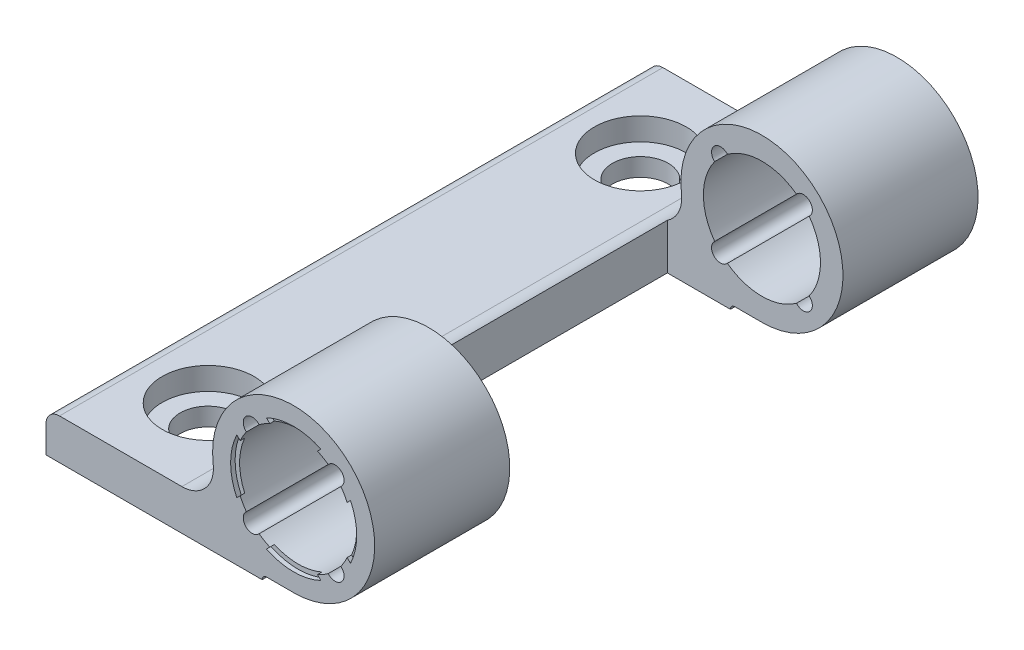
ISO-10303-21;
HEADER;
FILE_DESCRIPTION(('STEP AP214'),'2;1');
FILE_NAME('part.step','',(''),(''),'','','');
FILE_SCHEMA(('AUTOMOTIVE_DESIGN { 1 0 10303 214 1 1 1 1 }'));
ENDSEC;
DATA;
#1=APPLICATION_CONTEXT('core data for automotive mechanical design processes');
#2=APPLICATION_PROTOCOL_DEFINITION('international standard','automotive_design',2000,#1);
#3=PRODUCT_CONTEXT('',#1,'mechanical');
#4=PRODUCT('Part','Part','',(#3));
#5=PRODUCT_RELATED_PRODUCT_CATEGORY('part','',(#4));
#6=PRODUCT_DEFINITION_FORMATION('','',#4);
#7=PRODUCT_DEFINITION_CONTEXT('part definition',#1,'design');
#8=PRODUCT_DEFINITION('design','',#6,#7);
#9=PRODUCT_DEFINITION_SHAPE('','',#8);
#10=(LENGTH_UNIT() NAMED_UNIT(*) SI_UNIT(.MILLI.,.METRE.));
#11=(NAMED_UNIT(*) PLANE_ANGLE_UNIT() SI_UNIT($,.RADIAN.));
#12=(NAMED_UNIT(*) SI_UNIT($,.STERADIAN.) SOLID_ANGLE_UNIT());
#13=UNCERTAINTY_MEASURE_WITH_UNIT(LENGTH_MEASURE(1.E-05),#10,'distance_accuracy_value','');
#14=(GEOMETRIC_REPRESENTATION_CONTEXT(3) GLOBAL_UNCERTAINTY_ASSIGNED_CONTEXT((#13)) GLOBAL_UNIT_ASSIGNED_CONTEXT((#10,
#11,#12)) REPRESENTATION_CONTEXT('',''));
#15=CARTESIAN_POINT('',(0.,0.,0.));
#16=DIRECTION('',(0.,0.,1.));
#17=DIRECTION('',(1.,0.,0.));
#18=AXIS2_PLACEMENT_3D('',#15,#16,#17);
#19=CARTESIAN_POINT('',(0.,0.,-0.5));
#20=DIRECTION('',(0.,0.,1.));
#21=DIRECTION('',(1.,0.,0.));
#22=AXIS2_PLACEMENT_3D('',#19,#20,#21);
#23=PLANE('',#22);
#24=CARTESIAN_POINT('',(0.,0.,-0.5));
#25=DIRECTION('',(0.,0.,-1.));
#26=DIRECTION('',(-1.,0.,0.));
#27=AXIS2_PLACEMENT_3D('',#24,#25,#26);
#28=CIRCLE('',#27,7.);
#29=CARTESIAN_POINT('',(-6.3136798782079,3.02282093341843,-0.5));
#30=VERTEX_POINT('',#29);
#31=CARTESIAN_POINT('',(-6.31367987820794,-3.02282093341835,-0.5));
#32=VERTEX_POINT('',#31);
#33=EDGE_CURVE('E568',#30,#32,#28,.F.);
#34=ORIENTED_EDGE('',*,*,#33,.T.);
#35=DIRECTION('',(0.707106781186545,0.70710678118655,0.));
#36=VECTOR('',#35,1.);
#37=CARTESIAN_POINT('',(-6.31367987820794,-3.02282093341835,-0.5));
#38=LINE('',#37,#36);
#39=CARTESIAN_POINT('',(-5.93699816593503,-2.64613922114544,-0.5));
#40=VERTEX_POINT('',#39);
#41=EDGE_CURVE('E776',#32,#40,#38,.T.);
#42=ORIENTED_EDGE('',*,*,#41,.T.);
#43=CARTESIAN_POINT('',(0.,0.,-0.5));
#44=DIRECTION('',(0.,0.,1.));
#45=DIRECTION('',(1.,0.,0.));
#46=AXIS2_PLACEMENT_3D('',#43,#44,#45);
#47=CIRCLE('',#46,6.50000000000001);
#48=CARTESIAN_POINT('',(-5.936998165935,2.64613922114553,-0.5));
#49=VERTEX_POINT('',#48);
#50=EDGE_CURVE('E587',#40,#49,#47,.F.);
#51=ORIENTED_EDGE('',*,*,#50,.T.);
#52=DIRECTION('',(-0.70710678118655,0.707106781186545,0.));
#53=VECTOR('',#52,1.);
#54=CARTESIAN_POINT('',(-5.936998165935,2.64613922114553,-0.5));
#55=LINE('',#54,#53);
#56=EDGE_CURVE('E778',#49,#30,#55,.T.);
#57=ORIENTED_EDGE('',*,*,#56,.T.);
#58=EDGE_LOOP('',(#34,#42,#51,#57));
#59=FACE_BOUND('',#58,.T.);
#60=ADVANCED_FACE('F17',(#59),#23,.T.);
#61=CARTESIAN_POINT('',(0.,0.,-0.5));
#62=DIRECTION('',(0.,0.,1.));
#63=DIRECTION('',(1.,0.,0.));
#64=AXIS2_PLACEMENT_3D('',#61,#62,#63);
#65=PLANE('',#64);
#66=CARTESIAN_POINT('',(0.,0.,-0.5));
#67=DIRECTION('',(0.,0.,-1.));
#68=DIRECTION('',(-1.,0.,0.));
#69=AXIS2_PLACEMENT_3D('',#66,#67,#68);
#70=CIRCLE('',#69,7.);
#71=CARTESIAN_POINT('',(3.02282093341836,6.31367987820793,-0.5));
#72=VERTEX_POINT('',#71);
#73=CARTESIAN_POINT('',(-3.02282093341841,6.31367987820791,-0.5));
#74=VERTEX_POINT('',#73);
#75=EDGE_CURVE('E564',#72,#74,#70,.F.);
#76=ORIENTED_EDGE('',*,*,#75,.T.);
#77=DIRECTION('',(-0.707106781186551,0.707106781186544,0.));
#78=VECTOR('',#77,1.);
#79=CARTESIAN_POINT('',(-2.26514105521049,5.55599999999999,-0.5));
#80=LINE('',#79,#78);
#81=CARTESIAN_POINT('',(-2.64613922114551,5.93699816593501,-0.5));
#82=VERTEX_POINT('',#81);
#83=EDGE_CURVE('E567',#82,#74,#80,.T.);
#84=ORIENTED_EDGE('',*,*,#83,.F.);
#85=CARTESIAN_POINT('',(0.,0.,-0.5));
#86=DIRECTION('',(0.,0.,1.));
#87=DIRECTION('',(1.,0.,0.));
#88=AXIS2_PLACEMENT_3D('',#85,#86,#87);
#89=CIRCLE('',#88,6.50000000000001);
#90=CARTESIAN_POINT('',(2.64613922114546,5.93699816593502,-0.5));
#91=VERTEX_POINT('',#90);
#92=EDGE_CURVE('E580',#82,#91,#89,.F.);
#93=ORIENTED_EDGE('',*,*,#92,.T.);
#94=DIRECTION('',(0.707106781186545,0.70710678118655,0.));
#95=VECTOR('',#94,1.);
#96=CARTESIAN_POINT('',(2.64613922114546,5.93699816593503,-0.5));
#97=LINE('',#96,#95);
#98=EDGE_CURVE('E771',#91,#72,#97,.T.);
#99=ORIENTED_EDGE('',*,*,#98,.T.);
#100=EDGE_LOOP('',(#76,#84,#93,#99));
#101=FACE_BOUND('',#100,.T.);
#102=ADVANCED_FACE('F1241',(#101),#65,.T.);
#103=CARTESIAN_POINT('',(0.,0.,-0.5));
#104=DIRECTION('',(0.,0.,1.));
#105=DIRECTION('',(1.,0.,0.));
#106=AXIS2_PLACEMENT_3D('',#103,#104,#105);
#107=PLANE('',#106);
#108=CARTESIAN_POINT('',(0.,0.,-0.5));
#109=DIRECTION('',(0.,0.,-1.));
#110=DIRECTION('',(-1.,0.,0.));
#111=AXIS2_PLACEMENT_3D('',#108,#109,#110);
#112=CIRCLE('',#111,7.);
#113=CARTESIAN_POINT('',(6.31367987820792,-3.02282093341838,-0.5));
#114=VERTEX_POINT('',#113);
#115=CARTESIAN_POINT('',(6.31367987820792,3.02282093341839,-0.5));
#116=VERTEX_POINT('',#115);
#117=EDGE_CURVE('E559',#114,#116,#112,.F.);
#118=ORIENTED_EDGE('',*,*,#117,.T.);
#119=DIRECTION('',(0.707106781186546,0.707106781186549,0.));
#120=VECTOR('',#119,1.);
#121=CARTESIAN_POINT('',(5.556,2.26514105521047,-0.5));
#122=LINE('',#121,#120);
#123=CARTESIAN_POINT('',(5.93699816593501,2.64613922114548,-0.5));
#124=VERTEX_POINT('',#123);
#125=EDGE_CURVE('E726',#124,#116,#122,.T.);
#126=ORIENTED_EDGE('',*,*,#125,.F.);
#127=CARTESIAN_POINT('',(0.,0.,-0.5));
#128=DIRECTION('',(0.,0.,1.));
#129=DIRECTION('',(1.,0.,0.));
#130=AXIS2_PLACEMENT_3D('',#127,#128,#129);
#131=CIRCLE('',#130,6.50000000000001);
#132=CARTESIAN_POINT('',(5.93699816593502,-2.64613922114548,-0.5));
#133=VERTEX_POINT('',#132);
#134=EDGE_CURVE('E573',#124,#133,#131,.F.);
#135=ORIENTED_EDGE('',*,*,#134,.T.);
#136=DIRECTION('',(0.707106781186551,-0.707106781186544,0.));
#137=VECTOR('',#136,1.);
#138=CARTESIAN_POINT('',(5.93699816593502,-2.64613922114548,-0.5));
#139=LINE('',#138,#137);
#140=EDGE_CURVE('E769',#133,#114,#139,.T.);
#141=ORIENTED_EDGE('',*,*,#140,.T.);
#142=EDGE_LOOP('',(#118,#126,#135,#141));
#143=FACE_BOUND('',#142,.T.);
#144=ADVANCED_FACE('F1238',(#143),#107,.T.);
#145=CARTESIAN_POINT('',(0.,0.,-0.5));
#146=DIRECTION('',(0.,0.,1.));
#147=DIRECTION('',(1.,0.,0.));
#148=AXIS2_PLACEMENT_3D('',#145,#146,#147);
#149=PLANE('',#148);
#150=CARTESIAN_POINT('',(0.,0.,-0.5));
#151=DIRECTION('',(0.,0.,-1.));
#152=DIRECTION('',(-1.,0.,0.));
#153=AXIS2_PLACEMENT_3D('',#150,#151,#152);
#154=CIRCLE('',#153,7.);
#155=CARTESIAN_POINT('',(-3.02282093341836,-6.31367987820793,-0.5));
#156=VERTEX_POINT('',#155);
#157=CARTESIAN_POINT('',(3.02282093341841,-6.31367987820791,-0.5));
#158=VERTEX_POINT('',#157);
#159=EDGE_CURVE('E555',#156,#158,#154,.F.);
#160=ORIENTED_EDGE('',*,*,#159,.T.);
#161=DIRECTION('',(0.707106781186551,-0.707106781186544,0.));
#162=VECTOR('',#161,1.);
#163=CARTESIAN_POINT('',(2.26514105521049,-5.55599999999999,-0.5));
#164=LINE('',#163,#162);
#165=CARTESIAN_POINT('',(2.64613922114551,-5.93699816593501,-0.5));
#166=VERTEX_POINT('',#165);
#167=EDGE_CURVE('E558',#166,#158,#164,.T.);
#168=ORIENTED_EDGE('',*,*,#167,.F.);
#169=CARTESIAN_POINT('',(0.,0.,-0.5));
#170=DIRECTION('',(0.,0.,1.));
#171=DIRECTION('',(1.,0.,0.));
#172=AXIS2_PLACEMENT_3D('',#169,#170,#171);
#173=CIRCLE('',#172,6.50000000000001);
#174=CARTESIAN_POINT('',(-2.64613922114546,-5.93699816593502,-0.5));
#175=VERTEX_POINT('',#174);
#176=EDGE_CURVE('E594',#166,#175,#173,.F.);
#177=ORIENTED_EDGE('',*,*,#176,.T.);
#178=DIRECTION('',(-0.707106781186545,-0.70710678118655,0.));
#179=VECTOR('',#178,1.);
#180=CARTESIAN_POINT('',(-2.64613922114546,-5.93699816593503,-0.5));
#181=LINE('',#180,#179);
#182=EDGE_CURVE('E416',#175,#156,#181,.T.);
#183=ORIENTED_EDGE('',*,*,#182,.T.);
#184=EDGE_LOOP('',(#160,#168,#177,#183));
#185=FACE_BOUND('',#184,.T.);
#186=ADVANCED_FACE('F1240',(#185),#149,.T.);
#187=CARTESIAN_POINT('',(0.,0.,-66.5));
#188=DIRECTION('',(0.,0.,-1.));
#189=DIRECTION('',(-1.,0.,0.));
#190=AXIS2_PLACEMENT_3D('',#187,#188,#189);
#191=PLANE('',#190);
#192=CARTESIAN_POINT('',(0.,0.,-66.5));
#193=DIRECTION('',(0.,0.,1.));
#194=DIRECTION('',(1.,0.,0.));
#195=AXIS2_PLACEMENT_3D('',#192,#193,#194);
#196=CIRCLE('',#195,7.);
#197=CARTESIAN_POINT('',(6.31367987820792,3.02282093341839,-66.5));
#198=VERTEX_POINT('',#197);
#199=CARTESIAN_POINT('',(6.31367987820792,-3.02282093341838,-66.5));
#200=VERTEX_POINT('',#199);
#201=EDGE_CURVE('E539',#198,#200,#196,.F.);
#202=ORIENTED_EDGE('',*,*,#201,.T.);
#203=DIRECTION('',(0.707106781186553,-0.707106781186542,0.));
#204=VECTOR('',#203,1.);
#205=CARTESIAN_POINT('',(6.31367987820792,-3.02282093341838,-66.5));
#206=LINE('',#205,#204);
#207=CARTESIAN_POINT('',(5.93699816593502,-2.64613922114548,-66.5));
#208=VERTEX_POINT('',#207);
#209=EDGE_CURVE('E542',#200,#208,#206,.F.);
#210=ORIENTED_EDGE('',*,*,#209,.T.);
#211=CARTESIAN_POINT('',(0.,0.,-66.5));
#212=DIRECTION('',(0.,0.,-1.));
#213=DIRECTION('',(-1.,0.,0.));
#214=AXIS2_PLACEMENT_3D('',#211,#212,#213);
#215=CIRCLE('',#214,6.50000000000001);
#216=CARTESIAN_POINT('',(5.93699816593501,2.64613922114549,-66.5));
#217=VERTEX_POINT('',#216);
#218=EDGE_CURVE('E525',#208,#217,#215,.F.);
#219=ORIENTED_EDGE('',*,*,#218,.T.);
#220=DIRECTION('',(-0.707106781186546,-0.707106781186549,0.));
#221=VECTOR('',#220,1.);
#222=CARTESIAN_POINT('',(5.556,2.26514105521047,-66.5));
#223=LINE('',#222,#221);
#224=EDGE_CURVE('E687',#217,#198,#223,.F.);
#225=ORIENTED_EDGE('',*,*,#224,.T.);
#226=EDGE_LOOP('',(#202,#210,#219,#225));
#227=FACE_BOUND('',#226,.T.);
#228=ADVANCED_FACE('F1247',(#227),#191,.T.);
#229=CARTESIAN_POINT('',(0.,0.,-66.5));
#230=DIRECTION('',(0.,0.,-1.));
#231=DIRECTION('',(-1.,0.,0.));
#232=AXIS2_PLACEMENT_3D('',#229,#230,#231);
#233=PLANE('',#232);
#234=CARTESIAN_POINT('',(0.,0.,-66.5));
#235=DIRECTION('',(0.,0.,1.));
#236=DIRECTION('',(1.,0.,0.));
#237=AXIS2_PLACEMENT_3D('',#234,#235,#236);
#238=CIRCLE('',#237,7.);
#239=CARTESIAN_POINT('',(-3.02282093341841,6.31367987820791,-66.5));
#240=VERTEX_POINT('',#239);
#241=CARTESIAN_POINT('',(3.02282093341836,6.31367987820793,-66.5));
#242=VERTEX_POINT('',#241);
#243=EDGE_CURVE('E535',#240,#242,#238,.F.);
#244=ORIENTED_EDGE('',*,*,#243,.T.);
#245=DIRECTION('',(0.707106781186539,0.707106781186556,0.));
#246=VECTOR('',#245,1.);
#247=CARTESIAN_POINT('',(3.02282093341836,6.31367987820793,-66.5));
#248=LINE('',#247,#246);
#249=CARTESIAN_POINT('',(2.64613922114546,5.93699816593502,-66.5));
#250=VERTEX_POINT('',#249);
#251=EDGE_CURVE('E538',#242,#250,#248,.F.);
#252=ORIENTED_EDGE('',*,*,#251,.T.);
#253=CARTESIAN_POINT('',(0.,0.,-66.5));
#254=DIRECTION('',(0.,0.,-1.));
#255=DIRECTION('',(-1.,0.,0.));
#256=AXIS2_PLACEMENT_3D('',#253,#254,#255);
#257=CIRCLE('',#256,6.50000000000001);
#258=CARTESIAN_POINT('',(-2.64613922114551,5.936998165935,-66.5));
#259=VERTEX_POINT('',#258);
#260=EDGE_CURVE('E521',#250,#259,#257,.F.);
#261=ORIENTED_EDGE('',*,*,#260,.T.);
#262=DIRECTION('',(0.707106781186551,-0.707106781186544,0.));
#263=VECTOR('',#262,1.);
#264=CARTESIAN_POINT('',(-2.26514105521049,5.55599999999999,-66.5));
#265=LINE('',#264,#263);
#266=EDGE_CURVE('E680',#259,#240,#265,.F.);
#267=ORIENTED_EDGE('',*,*,#266,.T.);
#268=EDGE_LOOP('',(#244,#252,#261,#267));
#269=FACE_BOUND('',#268,.T.);
#270=ADVANCED_FACE('F1254',(#269),#233,.T.);
#271=CARTESIAN_POINT('',(0.,0.,-66.5));
#272=DIRECTION('',(0.,0.,-1.));
#273=DIRECTION('',(-1.,0.,0.));
#274=AXIS2_PLACEMENT_3D('',#271,#272,#273);
#275=PLANE('',#274);
#276=CARTESIAN_POINT('',(0.,0.,-66.5));
#277=DIRECTION('',(0.,0.,1.));
#278=DIRECTION('',(1.,0.,0.));
#279=AXIS2_PLACEMENT_3D('',#276,#277,#278);
#280=CIRCLE('',#279,7.);
#281=CARTESIAN_POINT('',(-6.31367987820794,-3.02282093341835,-66.5));
#282=VERTEX_POINT('',#281);
#283=CARTESIAN_POINT('',(-6.3136798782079,3.02282093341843,-66.5));
#284=VERTEX_POINT('',#283);
#285=EDGE_CURVE('E530',#282,#284,#280,.F.);
#286=ORIENTED_EDGE('',*,*,#285,.T.);
#287=DIRECTION('',(-0.707106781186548,0.707106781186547,0.));
#288=VECTOR('',#287,1.);
#289=CARTESIAN_POINT('',(-6.3136798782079,3.02282093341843,-66.5));
#290=LINE('',#289,#288);
#291=CARTESIAN_POINT('',(-5.936998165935,2.64613922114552,-66.5));
#292=VERTEX_POINT('',#291);
#293=EDGE_CURVE('E672',#284,#292,#290,.F.);
#294=ORIENTED_EDGE('',*,*,#293,.T.);
#295=CARTESIAN_POINT('',(0.,0.,-66.5));
#296=DIRECTION('',(0.,0.,-1.));
#297=DIRECTION('',(-1.,0.,0.));
#298=AXIS2_PLACEMENT_3D('',#295,#296,#297);
#299=CIRCLE('',#298,6.50000000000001);
#300=CARTESIAN_POINT('',(-5.93699816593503,-2.64613922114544,-66.5));
#301=VERTEX_POINT('',#300);
#302=EDGE_CURVE('E517',#292,#301,#299,.F.);
#303=ORIENTED_EDGE('',*,*,#302,.T.);
#304=DIRECTION('',(0.707106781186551,0.707106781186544,0.));
#305=VECTOR('',#304,1.);
#306=CARTESIAN_POINT('',(-5.55600000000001,-2.26514105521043,-66.5));
#307=LINE('',#306,#305);
#308=EDGE_CURVE('E550',#301,#282,#307,.F.);
#309=ORIENTED_EDGE('',*,*,#308,.T.);
#310=EDGE_LOOP('',(#286,#294,#303,#309));
#311=FACE_BOUND('',#310,.T.);
#312=ADVANCED_FACE('F1258',(#311),#275,.T.);
#313=CARTESIAN_POINT('',(0.,0.,-66.5));
#314=DIRECTION('',(0.,0.,-1.));
#315=DIRECTION('',(-1.,0.,0.));
#316=AXIS2_PLACEMENT_3D('',#313,#314,#315);
#317=PLANE('',#316);
#318=CARTESIAN_POINT('',(0.,0.,-66.5));
#319=DIRECTION('',(0.,0.,1.));
#320=DIRECTION('',(1.,0.,0.));
#321=AXIS2_PLACEMENT_3D('',#318,#319,#320);
#322=CIRCLE('',#321,7.);
#323=CARTESIAN_POINT('',(3.02282093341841,-6.31367987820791,-66.5));
#324=VERTEX_POINT('',#323);
#325=CARTESIAN_POINT('',(-3.02282093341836,-6.31367987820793,-66.5));
#326=VERTEX_POINT('',#325);
#327=EDGE_CURVE('E543',#324,#326,#322,.F.);
#328=ORIENTED_EDGE('',*,*,#327,.T.);
#329=DIRECTION('',(-0.707106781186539,-0.707106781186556,0.));
#330=VECTOR('',#329,1.);
#331=CARTESIAN_POINT('',(-3.02282093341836,-6.31367987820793,-66.5));
#332=LINE('',#331,#330);
#333=CARTESIAN_POINT('',(-2.64613922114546,-5.93699816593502,-66.5));
#334=VERTEX_POINT('',#333);
#335=EDGE_CURVE('E546',#326,#334,#332,.F.);
#336=ORIENTED_EDGE('',*,*,#335,.T.);
#337=CARTESIAN_POINT('',(0.,0.,-66.5));
#338=DIRECTION('',(0.,0.,-1.));
#339=DIRECTION('',(-1.,0.,0.));
#340=AXIS2_PLACEMENT_3D('',#337,#338,#339);
#341=CIRCLE('',#340,6.50000000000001);
#342=CARTESIAN_POINT('',(2.64613922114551,-5.936998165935,-66.5));
#343=VERTEX_POINT('',#342);
#344=EDGE_CURVE('E513',#334,#343,#341,.F.);
#345=ORIENTED_EDGE('',*,*,#344,.T.);
#346=DIRECTION('',(-0.707106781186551,0.707106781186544,0.));
#347=VECTOR('',#346,1.);
#348=CARTESIAN_POINT('',(2.26514105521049,-5.55599999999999,-66.5));
#349=LINE('',#348,#347);
#350=EDGE_CURVE('E695',#343,#324,#349,.F.);
#351=ORIENTED_EDGE('',*,*,#350,.T.);
#352=EDGE_LOOP('',(#328,#336,#345,#351));
#353=FACE_BOUND('',#352,.T.);
#354=ADVANCED_FACE('F1262',(#353),#317,.T.);
#355=CARTESIAN_POINT('',(-19.,-5.00000000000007,-9.5));
#356=DIRECTION('',(0.,-1.,0.));
#357=DIRECTION('',(1.,0.,0.));
#358=AXIS2_PLACEMENT_3D('',#355,#356,#357);
#359=CYLINDRICAL_SURFACE('',#358,5.10000000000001);
#360=CARTESIAN_POINT('',(-19.,-5.00000000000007,-9.5));
#361=DIRECTION('',(0.,-1.,0.));
#362=DIRECTION('',(1.,0.,0.));
#363=AXIS2_PLACEMENT_3D('',#360,#361,#362);
#364=CIRCLE('',#363,5.10000000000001);
#365=CARTESIAN_POINT('',(-13.9,-5.00000000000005,-9.5));
#366=VERTEX_POINT('',#365);
#367=EDGE_CURVE('E551',#366,#366,#364,.T.);
#368=ORIENTED_EDGE('',*,*,#367,.F.);
#369=EDGE_LOOP('',(#368));
#370=FACE_BOUND('',#369,.T.);
#371=CARTESIAN_POINT('',(-19.,-7.50000000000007,-9.5));
#372=DIRECTION('',(0.,-1.,0.));
#373=DIRECTION('',(1.,0.,0.));
#374=AXIS2_PLACEMENT_3D('',#371,#372,#373);
#375=CIRCLE('',#374,5.10000000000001);
#376=CARTESIAN_POINT('',(-13.9,-7.50000000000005,-9.5));
#377=VERTEX_POINT('',#376);
#378=EDGE_CURVE('E509',#377,#377,#375,.T.);
#379=ORIENTED_EDGE('',*,*,#378,.T.);
#380=EDGE_LOOP('',(#379));
#381=FACE_BOUND('',#380,.T.);
#382=ADVANCED_FACE('F1266',(#370,#381),#359,.F.);
#383=CARTESIAN_POINT('',(-19.,-5.00000000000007,-57.5));
#384=DIRECTION('',(0.,-1.,0.));
#385=DIRECTION('',(1.,0.,0.));
#386=AXIS2_PLACEMENT_3D('',#383,#384,#385);
#387=CYLINDRICAL_SURFACE('',#386,5.10000000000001);
#388=CARTESIAN_POINT('',(-19.,-5.00000000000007,-57.5));
#389=DIRECTION('',(0.,-1.,0.));
#390=DIRECTION('',(1.,0.,0.));
#391=AXIS2_PLACEMENT_3D('',#388,#389,#390);
#392=CIRCLE('',#391,5.10000000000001);
#393=CARTESIAN_POINT('',(-13.9,-5.00000000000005,-57.5));
#394=VERTEX_POINT('',#393);
#395=EDGE_CURVE('E547',#394,#394,#392,.T.);
#396=ORIENTED_EDGE('',*,*,#395,.F.);
#397=EDGE_LOOP('',(#396));
#398=FACE_BOUND('',#397,.T.);
#399=CARTESIAN_POINT('',(-19.,-7.50000000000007,-57.5));
#400=DIRECTION('',(0.,-1.,0.));
#401=DIRECTION('',(1.,0.,0.));
#402=AXIS2_PLACEMENT_3D('',#399,#400,#401);
#403=CIRCLE('',#402,5.10000000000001);
#404=CARTESIAN_POINT('',(-13.9,-7.50000000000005,-57.5));
#405=VERTEX_POINT('',#404);
#406=EDGE_CURVE('E506',#405,#405,#403,.T.);
#407=ORIENTED_EDGE('',*,*,#406,.T.);
#408=EDGE_LOOP('',(#407));
#409=FACE_BOUND('',#408,.T.);
#410=ADVANCED_FACE('F1270',(#398,#409),#387,.F.);
#411=CARTESIAN_POINT('',(0.,0.,-15.));
#412=DIRECTION('',(0.,0.,1.));
#413=DIRECTION('',(1.,0.,0.));
#414=AXIS2_PLACEMENT_3D('',#411,#412,#413);
#415=CYLINDRICAL_SURFACE('',#414,6.50000000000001);
#416=ORIENTED_EDGE('',*,*,#176,.F.);
#417=DIRECTION('',(0.,0.,1.));
#418=VECTOR('',#417,1.);
#419=CARTESIAN_POINT('',(2.64613922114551,-5.93699816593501,-0.5));
#420=LINE('',#419,#418);
#421=CARTESIAN_POINT('',(2.64613922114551,-5.93699816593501,0.));
#422=VERTEX_POINT('',#421);
#423=EDGE_CURVE('E602',#422,#166,#420,.F.);
#424=ORIENTED_EDGE('',*,*,#423,.F.);
#425=CARTESIAN_POINT('',(0.,0.,0.));
#426=DIRECTION('',(0.,0.,1.));
#427=DIRECTION('',(1.,0.,0.));
#428=AXIS2_PLACEMENT_3D('',#425,#426,#427);
#429=CIRCLE('',#428,6.50000000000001);
#430=CARTESIAN_POINT('',(3.83678960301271,-5.24681289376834,0.));
#431=VERTEX_POINT('',#430);
#432=EDGE_CURVE('E415',#431,#422,#429,.F.);
#433=ORIENTED_EDGE('',*,*,#432,.F.);
#434=DIRECTION('',(0.,0.,1.));
#435=VECTOR('',#434,1.);
#436=CARTESIAN_POINT('',(3.83678960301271,-5.24681289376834,-15.));
#437=LINE('',#436,#435);
#438=CARTESIAN_POINT('',(3.83678960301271,-5.24681289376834,-15.));
#439=VERTEX_POINT('',#438);
#440=EDGE_CURVE('E718',#431,#439,#437,.F.);
#441=ORIENTED_EDGE('',*,*,#440,.T.);
#442=CARTESIAN_POINT('',(0.,0.,-15.));
#443=DIRECTION('',(0.,0.,1.));
#444=DIRECTION('',(1.,0.,0.));
#445=AXIS2_PLACEMENT_3D('',#442,#443,#444);
#446=CIRCLE('',#445,6.50000000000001);
#447=CARTESIAN_POINT('',(-3.83678960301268,-5.24681289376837,-15.));
#448=VERTEX_POINT('',#447);
#449=EDGE_CURVE('E421',#439,#448,#446,.F.);
#450=ORIENTED_EDGE('',*,*,#449,.T.);
#451=DIRECTION('',(0.,0.,1.));
#452=VECTOR('',#451,1.);
#453=CARTESIAN_POINT('',(-3.83678960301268,-5.24681289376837,-15.));
#454=LINE('',#453,#452);
#455=CARTESIAN_POINT('',(-3.83678960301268,-5.24681289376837,0.));
#456=VERTEX_POINT('',#455);
#457=EDGE_CURVE('E418',#448,#456,#454,.T.);
#458=ORIENTED_EDGE('',*,*,#457,.T.);
#459=CARTESIAN_POINT('',(0.,0.,0.));
#460=DIRECTION('',(0.,0.,1.));
#461=DIRECTION('',(1.,0.,0.));
#462=AXIS2_PLACEMENT_3D('',#459,#460,#461);
#463=CIRCLE('',#462,6.50000000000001);
#464=CARTESIAN_POINT('',(-2.64613922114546,-5.93699816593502,0.));
#465=VERTEX_POINT('',#464);
#466=EDGE_CURVE('E20',#465,#456,#463,.F.);
#467=ORIENTED_EDGE('',*,*,#466,.F.);
#468=DIRECTION('',(0.,0.,1.));
#469=VECTOR('',#468,1.);
#470=CARTESIAN_POINT('',(-2.64613922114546,-5.93699816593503,-0.5));
#471=LINE('',#470,#469);
#472=EDGE_CURVE('E713',#175,#465,#471,.T.);
#473=ORIENTED_EDGE('',*,*,#472,.F.);
#474=EDGE_LOOP('',(#416,#424,#433,#441,#450,#458,#467,#473));
#475=FACE_BOUND('',#474,.T.);
#476=ADVANCED_FACE('F419',(#475),#415,.F.);
#477=CARTESIAN_POINT('',(0.,0.,-15.));
#478=DIRECTION('',(0.,0.,1.));
#479=DIRECTION('',(1.,0.,0.));
#480=AXIS2_PLACEMENT_3D('',#477,#478,#479);
#481=CYLINDRICAL_SURFACE('',#480,6.50000000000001);
#482=DIRECTION('',(0.,0.,1.));
#483=VECTOR('',#482,1.);
#484=CARTESIAN_POINT('',(-5.93699816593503,-2.64613922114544,-0.5));
#485=LINE('',#484,#483);
#486=CARTESIAN_POINT('',(-5.93699816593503,-2.64613922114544,0.));
#487=VERTEX_POINT('',#486);
#488=EDGE_CURVE('E425',#487,#40,#485,.F.);
#489=ORIENTED_EDGE('',*,*,#488,.F.);
#490=CARTESIAN_POINT('',(0.,0.,0.));
#491=DIRECTION('',(0.,0.,1.));
#492=DIRECTION('',(1.,0.,0.));
#493=AXIS2_PLACEMENT_3D('',#490,#491,#492);
#494=CIRCLE('',#493,6.50000000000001);
#495=CARTESIAN_POINT('',(-5.24681289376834,-3.83678960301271,0.));
#496=VERTEX_POINT('',#495);
#497=EDGE_CURVE('E590',#496,#487,#494,.F.);
#498=ORIENTED_EDGE('',*,*,#497,.F.);
#499=DIRECTION('',(0.,0.,1.));
#500=VECTOR('',#499,1.);
#501=CARTESIAN_POINT('',(-5.24681289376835,-3.83678960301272,-15.));
#502=LINE('',#501,#500);
#503=CARTESIAN_POINT('',(-5.24681289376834,-3.83678960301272,-15.));
#504=VERTEX_POINT('',#503);
#505=EDGE_CURVE('E426',#496,#504,#502,.F.);
#506=ORIENTED_EDGE('',*,*,#505,.T.);
#507=CARTESIAN_POINT('',(0.,0.,-15.));
#508=DIRECTION('',(0.,0.,1.));
#509=DIRECTION('',(1.,0.,0.));
#510=AXIS2_PLACEMENT_3D('',#507,#508,#509);
#511=CIRCLE('',#510,6.50000000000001);
#512=CARTESIAN_POINT('',(-5.24681289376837,3.83678960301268,-15.));
#513=VERTEX_POINT('',#512);
#514=EDGE_CURVE('E496',#504,#513,#511,.F.);
#515=ORIENTED_EDGE('',*,*,#514,.T.);
#516=DIRECTION('',(0.,0.,1.));
#517=VECTOR('',#516,1.);
#518=CARTESIAN_POINT('',(-5.24681289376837,3.83678960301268,-15.));
#519=LINE('',#518,#517);
#520=CARTESIAN_POINT('',(-5.24681289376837,3.83678960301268,0.));
#521=VERTEX_POINT('',#520);
#522=EDGE_CURVE('E745',#513,#521,#519,.T.);
#523=ORIENTED_EDGE('',*,*,#522,.T.);
#524=CARTESIAN_POINT('',(0.,0.,0.));
#525=DIRECTION('',(0.,0.,1.));
#526=DIRECTION('',(1.,0.,0.));
#527=AXIS2_PLACEMENT_3D('',#524,#525,#526);
#528=CIRCLE('',#527,6.50000000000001);
#529=CARTESIAN_POINT('',(-5.936998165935,2.64613922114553,0.));
#530=VERTEX_POINT('',#529);
#531=EDGE_CURVE('E592',#530,#521,#528,.F.);
#532=ORIENTED_EDGE('',*,*,#531,.F.);
#533=DIRECTION('',(0.,0.,1.));
#534=VECTOR('',#533,1.);
#535=CARTESIAN_POINT('',(-5.936998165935,2.64613922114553,-0.5));
#536=LINE('',#535,#534);
#537=EDGE_CURVE('E571',#49,#530,#536,.T.);
#538=ORIENTED_EDGE('',*,*,#537,.F.);
#539=ORIENTED_EDGE('',*,*,#50,.F.);
#540=EDGE_LOOP('',(#489,#498,#506,#515,#523,#532,#538,#539));
#541=FACE_BOUND('',#540,.T.);
#542=ADVANCED_FACE('F1203',(#541),#481,.F.);
#543=CARTESIAN_POINT('',(0.,0.,-15.));
#544=DIRECTION('',(0.,0.,1.));
#545=DIRECTION('',(1.,0.,0.));
#546=AXIS2_PLACEMENT_3D('',#543,#544,#545);
#547=CYLINDRICAL_SURFACE('',#546,6.50000000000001);
#548=ORIENTED_EDGE('',*,*,#92,.F.);
#549=DIRECTION('',(0.,0.,1.));
#550=VECTOR('',#549,1.);
#551=CARTESIAN_POINT('',(-2.64613922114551,5.93699816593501,-0.5));
#552=LINE('',#551,#550);
#553=CARTESIAN_POINT('',(-2.64613922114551,5.93699816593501,0.));
#554=VERTEX_POINT('',#553);
#555=EDGE_CURVE('E742',#554,#82,#552,.F.);
#556=ORIENTED_EDGE('',*,*,#555,.F.);
#557=CARTESIAN_POINT('',(0.,0.,0.));
#558=DIRECTION('',(0.,0.,1.));
#559=DIRECTION('',(1.,0.,0.));
#560=AXIS2_PLACEMENT_3D('',#557,#558,#559);
#561=CIRCLE('',#560,6.50000000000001);
#562=CARTESIAN_POINT('',(-3.83678960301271,5.24681289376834,0.));
#563=VERTEX_POINT('',#562);
#564=EDGE_CURVE('E583',#563,#554,#561,.F.);
#565=ORIENTED_EDGE('',*,*,#564,.F.);
#566=DIRECTION('',(0.,0.,1.));
#567=VECTOR('',#566,1.);
#568=CARTESIAN_POINT('',(-3.83678960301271,5.24681289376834,-15.));
#569=LINE('',#568,#567);
#570=CARTESIAN_POINT('',(-3.83678960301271,5.24681289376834,-15.));
#571=VERTEX_POINT('',#570);
#572=EDGE_CURVE('E748',#563,#571,#569,.F.);
#573=ORIENTED_EDGE('',*,*,#572,.T.);
#574=CARTESIAN_POINT('',(0.,0.,-15.));
#575=DIRECTION('',(0.,0.,1.));
#576=DIRECTION('',(1.,0.,0.));
#577=AXIS2_PLACEMENT_3D('',#574,#575,#576);
#578=CIRCLE('',#577,6.50000000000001);
#579=CARTESIAN_POINT('',(3.83678960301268,5.24681289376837,-15.));
#580=VERTEX_POINT('',#579);
#581=EDGE_CURVE('E491',#571,#580,#578,.F.);
#582=ORIENTED_EDGE('',*,*,#581,.T.);
#583=DIRECTION('',(0.,0.,1.));
#584=VECTOR('',#583,1.);
#585=CARTESIAN_POINT('',(3.83678960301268,5.24681289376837,-15.));
#586=LINE('',#585,#584);
#587=CARTESIAN_POINT('',(3.83678960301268,5.24681289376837,0.));
#588=VERTEX_POINT('',#587);
#589=EDGE_CURVE('E730',#580,#588,#586,.T.);
#590=ORIENTED_EDGE('',*,*,#589,.T.);
#591=CARTESIAN_POINT('',(0.,0.,0.));
#592=DIRECTION('',(0.,0.,1.));
#593=DIRECTION('',(1.,0.,0.));
#594=AXIS2_PLACEMENT_3D('',#591,#592,#593);
#595=CIRCLE('',#594,6.50000000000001);
#596=CARTESIAN_POINT('',(2.64613922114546,5.93699816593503,0.));
#597=VERTEX_POINT('',#596);
#598=EDGE_CURVE('E585',#597,#588,#595,.F.);
#599=ORIENTED_EDGE('',*,*,#598,.F.);
#600=DIRECTION('',(0.,0.,1.));
#601=VECTOR('',#600,1.);
#602=CARTESIAN_POINT('',(2.64613922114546,5.93699816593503,-0.5));
#603=LINE('',#602,#601);
#604=EDGE_CURVE('E738',#91,#597,#603,.T.);
#605=ORIENTED_EDGE('',*,*,#604,.F.);
#606=EDGE_LOOP('',(#548,#556,#565,#573,#582,#590,#599,#605));
#607=FACE_BOUND('',#606,.T.);
#608=ADVANCED_FACE('F1001',(#607),#547,.F.);
#609=CARTESIAN_POINT('',(0.,0.,-15.));
#610=DIRECTION('',(0.,0.,1.));
#611=DIRECTION('',(1.,0.,0.));
#612=AXIS2_PLACEMENT_3D('',#609,#610,#611);
#613=CYLINDRICAL_SURFACE('',#612,6.50000000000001);
#614=ORIENTED_EDGE('',*,*,#134,.F.);
#615=DIRECTION('',(0.,0.,1.));
#616=VECTOR('',#615,1.);
#617=CARTESIAN_POINT('',(5.93699816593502,2.64613922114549,-0.5));
#618=LINE('',#617,#616);
#619=CARTESIAN_POINT('',(5.93699816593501,2.64613922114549,0.));
#620=VERTEX_POINT('',#619);
#621=EDGE_CURVE('E727',#620,#124,#618,.F.);
#622=ORIENTED_EDGE('',*,*,#621,.F.);
#623=CARTESIAN_POINT('',(0.,0.,0.));
#624=DIRECTION('',(0.,0.,1.));
#625=DIRECTION('',(1.,0.,0.));
#626=AXIS2_PLACEMENT_3D('',#623,#624,#625);
#627=CIRCLE('',#626,6.50000000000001);
#628=CARTESIAN_POINT('',(5.24681289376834,3.83678960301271,0.));
#629=VERTEX_POINT('',#628);
#630=EDGE_CURVE('E576',#629,#620,#627,.F.);
#631=ORIENTED_EDGE('',*,*,#630,.F.);
#632=DIRECTION('',(0.,0.,1.));
#633=VECTOR('',#632,1.);
#634=CARTESIAN_POINT('',(5.24681289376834,3.83678960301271,-15.));
#635=LINE('',#634,#633);
#636=CARTESIAN_POINT('',(5.24681289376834,3.83678960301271,-15.));
#637=VERTEX_POINT('',#636);
#638=EDGE_CURVE('E733',#629,#637,#635,.F.);
#639=ORIENTED_EDGE('',*,*,#638,.T.);
#640=CARTESIAN_POINT('',(0.,0.,-15.));
#641=DIRECTION('',(0.,0.,1.));
#642=DIRECTION('',(1.,0.,0.));
#643=AXIS2_PLACEMENT_3D('',#640,#641,#642);
#644=CIRCLE('',#643,6.50000000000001);
#645=CARTESIAN_POINT('',(5.24681289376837,-3.83678960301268,-15.));
#646=VERTEX_POINT('',#645);
#647=EDGE_CURVE('E486',#637,#646,#644,.F.);
#648=ORIENTED_EDGE('',*,*,#647,.T.);
#649=DIRECTION('',(0.,0.,1.));
#650=VECTOR('',#649,1.);
#651=CARTESIAN_POINT('',(5.24681289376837,-3.83678960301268,-15.));
#652=LINE('',#651,#650);
#653=CARTESIAN_POINT('',(5.24681289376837,-3.83678960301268,0.));
#654=VERTEX_POINT('',#653);
#655=EDGE_CURVE('E606',#646,#654,#652,.T.);
#656=ORIENTED_EDGE('',*,*,#655,.T.);
#657=CARTESIAN_POINT('',(0.,0.,0.));
#658=DIRECTION('',(0.,0.,1.));
#659=DIRECTION('',(1.,0.,0.));
#660=AXIS2_PLACEMENT_3D('',#657,#658,#659);
#661=CIRCLE('',#660,6.50000000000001);
#662=CARTESIAN_POINT('',(5.93699816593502,-2.64613922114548,0.));
#663=VERTEX_POINT('',#662);
#664=EDGE_CURVE('E578',#663,#654,#661,.F.);
#665=ORIENTED_EDGE('',*,*,#664,.F.);
#666=DIRECTION('',(0.,0.,1.));
#667=VECTOR('',#666,1.);
#668=CARTESIAN_POINT('',(5.93699816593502,-2.64613922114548,-0.5));
#669=LINE('',#668,#667);
#670=EDGE_CURVE('E562',#133,#663,#669,.T.);
#671=ORIENTED_EDGE('',*,*,#670,.F.);
#672=EDGE_LOOP('',(#614,#622,#631,#639,#648,#656,#665,#671));
#673=FACE_BOUND('',#672,.T.);
#674=ADVANCED_FACE('F992',(#673),#613,.F.);
#675=CARTESIAN_POINT('',(0.,-9.,0.));
#676=DIRECTION('',(0.,-1.,0.));
#677=DIRECTION('',(1.,0.,0.));
#678=AXIS2_PLACEMENT_3D('',#675,#676,#677);
#679=PLANE('',#678);
#680=DIRECTION('',(1.,0.,0.));
#681=VECTOR('',#680,1.);
#682=CARTESIAN_POINT('',(-2.99999999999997,-9.00000000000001,0.));
#683=LINE('',#682,#681);
#684=CARTESIAN_POINT('',(-2.99999999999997,-9.00000000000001,0.));
#685=VERTEX_POINT('',#684);
#686=CARTESIAN_POINT('',(0.,-9.00000000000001,0.));
#687=VERTEX_POINT('',#686);
#688=EDGE_CURVE('E476',#685,#687,#683,.T.);
#689=ORIENTED_EDGE('',*,*,#688,.F.);
#690=DIRECTION('',(0.,0.,1.));
#691=VECTOR('',#690,1.);
#692=CARTESIAN_POINT('',(-2.99999999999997,-9.00000000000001,0.));
#693=LINE('',#692,#691);
#694=CARTESIAN_POINT('',(-2.99999999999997,-9.00000000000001,-15.));
#695=VERTEX_POINT('',#694);
#696=EDGE_CURVE('E482',#685,#695,#693,.F.);
#697=ORIENTED_EDGE('',*,*,#696,.T.);
#698=DIRECTION('',(1.,0.,0.));
#699=VECTOR('',#698,1.);
#700=CARTESIAN_POINT('',(-2.99999999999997,-9.00000000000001,-15.));
#701=LINE('',#700,#699);
#702=CARTESIAN_POINT('',(0.,-9.00000000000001,-15.));
#703=VERTEX_POINT('',#702);
#704=EDGE_CURVE('E505',#695,#703,#701,.T.);
#705=ORIENTED_EDGE('',*,*,#704,.T.);
#706=DIRECTION('',(0.,0.,1.));
#707=VECTOR('',#706,1.);
#708=CARTESIAN_POINT('',(0.,-9.,0.));
#709=LINE('',#708,#707);
#710=EDGE_CURVE('E572',#687,#703,#709,.F.);
#711=ORIENTED_EDGE('',*,*,#710,.F.);
#712=EDGE_LOOP('',(#689,#697,#705,#711));
#713=FACE_BOUND('',#712,.T.);
#714=ADVANCED_FACE('F990',(#713),#679,.T.);
#715=CARTESIAN_POINT('',(0.,0.,0.));
#716=DIRECTION('',(0.,0.,1.));
#717=DIRECTION('',(1.,0.,0.));
#718=AXIS2_PLACEMENT_3D('',#715,#716,#717);
#719=CYLINDRICAL_SURFACE('',#718,9.);
#720=CARTESIAN_POINT('',(0.,0.,-15.));
#721=DIRECTION('',(0.,0.,1.));
#722=DIRECTION('',(1.,0.,0.));
#723=AXIS2_PLACEMENT_3D('',#720,#721,#722);
#724=CIRCLE('',#723,9.);
#725=CARTESIAN_POINT('',(-8.93496502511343,-1.08000000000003,-15.));
#726=VERTEX_POINT('',#725);
#727=EDGE_CURVE('E503',#703,#726,#724,.T.);
#728=ORIENTED_EDGE('',*,*,#727,.T.);
#729=DIRECTION('',(0.,0.,1.));
#730=VECTOR('',#729,1.);
#731=CARTESIAN_POINT('',(-8.93496502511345,-1.08000000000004,0.));
#732=LINE('',#731,#730);
#733=CARTESIAN_POINT('',(-8.93496502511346,-1.08000000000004,0.));
#734=VERTEX_POINT('',#733);
#735=EDGE_CURVE('E692',#726,#734,#732,.T.);
#736=ORIENTED_EDGE('',*,*,#735,.T.);
#737=CARTESIAN_POINT('',(0.,0.,0.));
#738=DIRECTION('',(0.,0.,1.));
#739=DIRECTION('',(1.,0.,0.));
#740=AXIS2_PLACEMENT_3D('',#737,#738,#739);
#741=CIRCLE('',#740,9.);
#742=EDGE_CURVE('E473',#687,#734,#741,.T.);
#743=ORIENTED_EDGE('',*,*,#742,.F.);
#744=ORIENTED_EDGE('',*,*,#710,.T.);
#745=EDGE_LOOP('',(#728,#736,#743,#744));
#746=FACE_BOUND('',#745,.T.);
#747=ADVANCED_FACE('F988',(#746),#719,.T.);
#748=CARTESIAN_POINT('',(0.,0.,-0.5));
#749=DIRECTION('',(0.,0.,-1.));
#750=DIRECTION('',(-1.,0.,0.));
#751=AXIS2_PLACEMENT_3D('',#748,#749,#750);
#752=CYLINDRICAL_SURFACE('',#751,7.);
#753=DIRECTION('',(0.,0.,1.));
#754=VECTOR('',#753,1.);
#755=CARTESIAN_POINT('',(-6.31367987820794,-3.02282093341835,-0.5));
#756=LINE('',#755,#754);
#757=CARTESIAN_POINT('',(-6.31367987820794,-3.02282093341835,0.));
#758=VERTEX_POINT('',#757);
#759=EDGE_CURVE('E701',#32,#758,#756,.T.);
#760=ORIENTED_EDGE('',*,*,#759,.F.);
#761=ORIENTED_EDGE('',*,*,#33,.F.);
#762=DIRECTION('',(0.,0.,1.));
#763=VECTOR('',#762,1.);
#764=CARTESIAN_POINT('',(-6.3136798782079,3.02282093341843,-0.5));
#765=LINE('',#764,#763);
#766=CARTESIAN_POINT('',(-6.3136798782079,3.02282093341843,0.));
#767=VERTEX_POINT('',#766);
#768=EDGE_CURVE('E750',#767,#30,#765,.F.);
#769=ORIENTED_EDGE('',*,*,#768,.F.);
#770=CARTESIAN_POINT('',(0.,0.,0.));
#771=DIRECTION('',(0.,0.,-1.));
#772=DIRECTION('',(-1.,0.,0.));
#773=AXIS2_PLACEMENT_3D('',#770,#771,#772);
#774=CIRCLE('',#773,7.);
#775=EDGE_CURVE('E463',#758,#767,#774,.T.);
#776=ORIENTED_EDGE('',*,*,#775,.F.);
#777=EDGE_LOOP('',(#760,#761,#769,#776));
#778=FACE_BOUND('',#777,.T.);
#779=ADVANCED_FACE('F999',(#778),#752,.F.);
#780=CARTESIAN_POINT('',(-6.3136798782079,3.02282093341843,-0.5));
#781=DIRECTION('',(-0.707106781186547,-0.707106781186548,0.));
#782=DIRECTION('',(0.707106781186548,-0.707106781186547,0.));
#783=AXIS2_PLACEMENT_3D('',#780,#781,#782);
#784=PLANE('',#783);
#785=ORIENTED_EDGE('',*,*,#768,.T.);
#786=ORIENTED_EDGE('',*,*,#56,.F.);
#787=ORIENTED_EDGE('',*,*,#537,.T.);
#788=DIRECTION('',(0.707106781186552,-0.707106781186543,0.));
#789=VECTOR('',#788,1.);
#790=CARTESIAN_POINT('',(-6.3136798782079,3.02282093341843,0.));
#791=LINE('',#790,#789);
#792=EDGE_CURVE('E462',#767,#530,#791,.T.);
#793=ORIENTED_EDGE('',*,*,#792,.F.);
#794=EDGE_LOOP('',(#785,#786,#787,#793));
#795=FACE_BOUND('',#794,.T.);
#796=ADVANCED_FACE('F1188',(#795),#784,.T.);
#797=CARTESIAN_POINT('',(-4.59619407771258,4.59619407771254,-15.));
#798=DIRECTION('',(0.,0.,1.));
#799=DIRECTION('',(1.,0.,0.));
#800=AXIS2_PLACEMENT_3D('',#797,#798,#799);
#801=CYLINDRICAL_SURFACE('',#800,1.00000000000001);
#802=ORIENTED_EDGE('',*,*,#522,.F.);
#803=CARTESIAN_POINT('',(-4.59619407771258,4.59619407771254,-15.));
#804=DIRECTION('',(0.,0.,1.));
#805=DIRECTION('',(1.,0.,0.));
#806=AXIS2_PLACEMENT_3D('',#803,#804,#805);
#807=CIRCLE('',#806,1.00000000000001);
#808=EDGE_CURVE('E493',#513,#571,#807,.F.);
#809=ORIENTED_EDGE('',*,*,#808,.T.);
#810=ORIENTED_EDGE('',*,*,#572,.F.);
#811=CARTESIAN_POINT('',(-4.59619407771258,4.59619407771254,0.));
#812=DIRECTION('',(0.,0.,1.));
#813=DIRECTION('',(1.,0.,0.));
#814=AXIS2_PLACEMENT_3D('',#811,#812,#813);
#815=CIRCLE('',#814,1.00000000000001);
#816=EDGE_CURVE('E459',#521,#563,#815,.F.);
#817=ORIENTED_EDGE('',*,*,#816,.F.);
#818=EDGE_LOOP('',(#802,#809,#810,#817));
#819=FACE_BOUND('',#818,.T.);
#820=ADVANCED_FACE('F1184',(#819),#801,.F.);
#821=CARTESIAN_POINT('',(-2.26514105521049,5.55599999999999,-0.5));
#822=DIRECTION('',(0.707106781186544,0.707106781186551,0.));
#823=DIRECTION('',(-0.707106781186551,0.707106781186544,0.));
#824=AXIS2_PLACEMENT_3D('',#821,#822,#823);
#825=PLANE('',#824);
#826=DIRECTION('',(0.,0.,-1.));
#827=VECTOR('',#826,1.);
#828=CARTESIAN_POINT('',(-3.02282093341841,6.31367987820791,-0.5));
#829=LINE('',#828,#827);
#830=CARTESIAN_POINT('',(-3.02282093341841,6.31367987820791,0.));
#831=VERTEX_POINT('',#830);
#832=EDGE_CURVE('E566',#74,#831,#829,.F.);
#833=ORIENTED_EDGE('',*,*,#832,.T.);
#834=DIRECTION('',(-0.707106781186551,0.707106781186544,0.));
#835=VECTOR('',#834,1.);
#836=CARTESIAN_POINT('',(-2.64613922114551,5.93699816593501,0.));
#837=LINE('',#836,#835);
#838=EDGE_CURVE('E458',#554,#831,#837,.T.);
#839=ORIENTED_EDGE('',*,*,#838,.F.);
#840=ORIENTED_EDGE('',*,*,#555,.T.);
#841=ORIENTED_EDGE('',*,*,#83,.T.);
#842=EDGE_LOOP('',(#833,#839,#840,#841));
#843=FACE_BOUND('',#842,.T.);
#844=ADVANCED_FACE('F1180',(#843),#825,.T.);
#845=CARTESIAN_POINT('',(0.,0.,-0.5));
#846=DIRECTION('',(0.,0.,-1.));
#847=DIRECTION('',(-1.,0.,0.));
#848=AXIS2_PLACEMENT_3D('',#845,#846,#847);
#849=CYLINDRICAL_SURFACE('',#848,7.);
#850=ORIENTED_EDGE('',*,*,#832,.F.);
#851=ORIENTED_EDGE('',*,*,#75,.F.);
#852=DIRECTION('',(0.,0.,1.));
#853=VECTOR('',#852,1.);
#854=CARTESIAN_POINT('',(3.02282093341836,6.31367987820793,-0.5));
#855=LINE('',#854,#853);
#856=CARTESIAN_POINT('',(3.02282093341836,6.31367987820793,0.));
#857=VERTEX_POINT('',#856);
#858=EDGE_CURVE('E735',#857,#72,#855,.F.);
#859=ORIENTED_EDGE('',*,*,#858,.F.);
#860=CARTESIAN_POINT('',(0.,0.,0.));
#861=DIRECTION('',(0.,0.,-1.));
#862=DIRECTION('',(-1.,0.,0.));
#863=AXIS2_PLACEMENT_3D('',#860,#861,#862);
#864=CIRCLE('',#863,7.);
#865=EDGE_CURVE('E455',#831,#857,#864,.T.);
#866=ORIENTED_EDGE('',*,*,#865,.F.);
#867=EDGE_LOOP('',(#850,#851,#859,#866));
#868=FACE_BOUND('',#867,.T.);
#869=ADVANCED_FACE('F1176',(#868),#849,.F.);
#870=CARTESIAN_POINT('',(3.02282093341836,6.31367987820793,-0.5));
#871=DIRECTION('',(-0.707106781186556,0.707106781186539,0.));
#872=DIRECTION('',(-0.707106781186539,-0.707106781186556,0.));
#873=AXIS2_PLACEMENT_3D('',#870,#871,#872);
#874=PLANE('',#873);
#875=ORIENTED_EDGE('',*,*,#858,.T.);
#876=ORIENTED_EDGE('',*,*,#98,.F.);
#877=ORIENTED_EDGE('',*,*,#604,.T.);
#878=DIRECTION('',(-0.707106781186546,-0.707106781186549,0.));
#879=VECTOR('',#878,1.);
#880=CARTESIAN_POINT('',(3.02282093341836,6.31367987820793,0.));
#881=LINE('',#880,#879);
#882=EDGE_CURVE('E454',#857,#597,#881,.T.);
#883=ORIENTED_EDGE('',*,*,#882,.F.);
#884=EDGE_LOOP('',(#875,#876,#877,#883));
#885=FACE_BOUND('',#884,.T.);
#886=ADVANCED_FACE('F1172',(#885),#874,.T.);
#887=CARTESIAN_POINT('',(4.59619407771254,4.59619407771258,-15.));
#888=DIRECTION('',(0.,0.,1.));
#889=DIRECTION('',(1.,0.,0.));
#890=AXIS2_PLACEMENT_3D('',#887,#888,#889);
#891=CYLINDRICAL_SURFACE('',#890,1.00000000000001);
#892=ORIENTED_EDGE('',*,*,#589,.F.);
#893=CARTESIAN_POINT('',(4.59619407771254,4.59619407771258,-15.));
#894=DIRECTION('',(0.,0.,1.));
#895=DIRECTION('',(1.,0.,0.));
#896=AXIS2_PLACEMENT_3D('',#893,#894,#895);
#897=CIRCLE('',#896,1.00000000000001);
#898=EDGE_CURVE('E488',#580,#637,#897,.F.);
#899=ORIENTED_EDGE('',*,*,#898,.T.);
#900=ORIENTED_EDGE('',*,*,#638,.F.);
#901=CARTESIAN_POINT('',(4.59619407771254,4.59619407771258,0.));
#902=DIRECTION('',(0.,0.,1.));
#903=DIRECTION('',(1.,0.,0.));
#904=AXIS2_PLACEMENT_3D('',#901,#902,#903);
#905=CIRCLE('',#904,1.00000000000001);
#906=EDGE_CURVE('E451',#588,#629,#905,.F.);
#907=ORIENTED_EDGE('',*,*,#906,.F.);
#908=EDGE_LOOP('',(#892,#899,#900,#907));
#909=FACE_BOUND('',#908,.T.);
#910=ADVANCED_FACE('F1168',(#909),#891,.F.);
#911=CARTESIAN_POINT('',(5.556,2.26514105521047,-0.5));
#912=DIRECTION('',(0.707106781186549,-0.707106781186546,0.));
#913=DIRECTION('',(0.707106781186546,0.707106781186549,0.));
#914=AXIS2_PLACEMENT_3D('',#911,#912,#913);
#915=PLANE('',#914);
#916=DIRECTION('',(0.,0.,-1.));
#917=VECTOR('',#916,1.);
#918=CARTESIAN_POINT('',(6.31367987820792,3.02282093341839,-0.5));
#919=LINE('',#918,#917);
#920=CARTESIAN_POINT('',(6.31367987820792,3.02282093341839,0.));
#921=VERTEX_POINT('',#920);
#922=EDGE_CURVE('E563',#116,#921,#919,.F.);
#923=ORIENTED_EDGE('',*,*,#922,.T.);
#924=DIRECTION('',(0.707106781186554,0.707106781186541,0.));
#925=VECTOR('',#924,1.);
#926=CARTESIAN_POINT('',(5.93699816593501,2.64613922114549,0.));
#927=LINE('',#926,#925);
#928=EDGE_CURVE('E450',#620,#921,#927,.T.);
#929=ORIENTED_EDGE('',*,*,#928,.F.);
#930=ORIENTED_EDGE('',*,*,#621,.T.);
#931=ORIENTED_EDGE('',*,*,#125,.T.);
#932=EDGE_LOOP('',(#923,#929,#930,#931));
#933=FACE_BOUND('',#932,.T.);
#934=ADVANCED_FACE('F1164',(#933),#915,.T.);
#935=CARTESIAN_POINT('',(0.,0.,-0.5));
#936=DIRECTION('',(0.,0.,-1.));
#937=DIRECTION('',(-1.,0.,0.));
#938=AXIS2_PLACEMENT_3D('',#935,#936,#937);
#939=CYLINDRICAL_SURFACE('',#938,7.);
#940=DIRECTION('',(0.,0.,1.));
#941=VECTOR('',#940,1.);
#942=CARTESIAN_POINT('',(6.31367987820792,-3.02282093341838,-0.5));
#943=LINE('',#942,#941);
#944=CARTESIAN_POINT('',(6.31367987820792,-3.02282093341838,0.));
#945=VERTEX_POINT('',#944);
#946=EDGE_CURVE('E720',#945,#114,#943,.F.);
#947=ORIENTED_EDGE('',*,*,#946,.F.);
#948=CARTESIAN_POINT('',(0.,0.,0.));
#949=DIRECTION('',(0.,0.,-1.));
#950=DIRECTION('',(-1.,0.,0.));
#951=AXIS2_PLACEMENT_3D('',#948,#949,#950);
#952=CIRCLE('',#951,7.);
#953=EDGE_CURVE('E447',#921,#945,#952,.T.);
#954=ORIENTED_EDGE('',*,*,#953,.F.);
#955=ORIENTED_EDGE('',*,*,#922,.F.);
#956=ORIENTED_EDGE('',*,*,#117,.F.);
#957=EDGE_LOOP('',(#947,#954,#955,#956));
#958=FACE_BOUND('',#957,.T.);
#959=ADVANCED_FACE('F1160',(#958),#939,.F.);
#960=CARTESIAN_POINT('',(6.31367987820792,-3.02282093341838,-0.5));
#961=DIRECTION('',(0.707106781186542,0.707106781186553,0.));
#962=DIRECTION('',(-0.707106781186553,0.707106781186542,0.));
#963=AXIS2_PLACEMENT_3D('',#960,#961,#962);
#964=PLANE('',#963);
#965=ORIENTED_EDGE('',*,*,#946,.T.);
#966=ORIENTED_EDGE('',*,*,#140,.F.);
#967=ORIENTED_EDGE('',*,*,#670,.T.);
#968=DIRECTION('',(-0.707106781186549,0.707106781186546,0.));
#969=VECTOR('',#968,1.);
#970=CARTESIAN_POINT('',(6.31367987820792,-3.02282093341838,0.));
#971=LINE('',#970,#969);
#972=EDGE_CURVE('E446',#945,#663,#971,.T.);
#973=ORIENTED_EDGE('',*,*,#972,.F.);
#974=EDGE_LOOP('',(#965,#966,#967,#973));
#975=FACE_BOUND('',#974,.T.);
#976=ADVANCED_FACE('F1156',(#975),#964,.T.);
#977=CARTESIAN_POINT('',(4.59619407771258,-4.59619407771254,-15.));
#978=DIRECTION('',(0.,0.,1.));
#979=DIRECTION('',(1.,0.,0.));
#980=AXIS2_PLACEMENT_3D('',#977,#978,#979);
#981=CYLINDRICAL_SURFACE('',#980,1.00000000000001);
#982=ORIENTED_EDGE('',*,*,#655,.F.);
#983=CARTESIAN_POINT('',(4.59619407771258,-4.59619407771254,-15.));
#984=DIRECTION('',(0.,0.,1.));
#985=DIRECTION('',(1.,0.,0.));
#986=AXIS2_PLACEMENT_3D('',#983,#984,#985);
#987=CIRCLE('',#986,1.00000000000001);
#988=EDGE_CURVE('E483',#646,#439,#987,.F.);
#989=ORIENTED_EDGE('',*,*,#988,.T.);
#990=ORIENTED_EDGE('',*,*,#440,.F.);
#991=CARTESIAN_POINT('',(4.59619407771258,-4.59619407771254,0.));
#992=DIRECTION('',(0.,0.,1.));
#993=DIRECTION('',(1.,0.,0.));
#994=AXIS2_PLACEMENT_3D('',#991,#992,#993);
#995=CIRCLE('',#994,1.00000000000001);
#996=EDGE_CURVE('E443',#654,#431,#995,.F.);
#997=ORIENTED_EDGE('',*,*,#996,.F.);
#998=EDGE_LOOP('',(#982,#989,#990,#997));
#999=FACE_BOUND('',#998,.T.);
#1000=ADVANCED_FACE('F1153',(#999),#981,.F.);
#1001=CARTESIAN_POINT('',(2.26514105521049,-5.55599999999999,-0.5));
#1002=DIRECTION('',(-0.707106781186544,-0.707106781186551,0.));
#1003=DIRECTION('',(0.707106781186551,-0.707106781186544,0.));
#1004=AXIS2_PLACEMENT_3D('',#1001,#1002,#1003);
#1005=PLANE('',#1004);
#1006=DIRECTION('',(0.,0.,-1.));
#1007=VECTOR('',#1006,1.);
#1008=CARTESIAN_POINT('',(3.02282093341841,-6.31367987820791,-0.5));
#1009=LINE('',#1008,#1007);
#1010=CARTESIAN_POINT('',(3.02282093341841,-6.31367987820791,0.));
#1011=VERTEX_POINT('',#1010);
#1012=EDGE_CURVE('E557',#158,#1011,#1009,.F.);
#1013=ORIENTED_EDGE('',*,*,#1012,.T.);
#1014=DIRECTION('',(0.70710678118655,-0.707106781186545,0.));
#1015=VECTOR('',#1014,1.);
#1016=CARTESIAN_POINT('',(2.64613922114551,-5.93699816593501,0.));
#1017=LINE('',#1016,#1015);
#1018=EDGE_CURVE('E442',#422,#1011,#1017,.T.);
#1019=ORIENTED_EDGE('',*,*,#1018,.F.);
#1020=ORIENTED_EDGE('',*,*,#423,.T.);
#1021=ORIENTED_EDGE('',*,*,#167,.T.);
#1022=EDGE_LOOP('',(#1013,#1019,#1020,#1021));
#1023=FACE_BOUND('',#1022,.T.);
#1024=ADVANCED_FACE('F608',(#1023),#1005,.T.);
#1025=CARTESIAN_POINT('',(0.,0.,-0.5));
#1026=DIRECTION('',(0.,0.,-1.));
#1027=DIRECTION('',(-1.,0.,0.));
#1028=AXIS2_PLACEMENT_3D('',#1025,#1026,#1027);
#1029=CYLINDRICAL_SURFACE('',#1028,7.);
#1030=ORIENTED_EDGE('',*,*,#1012,.F.);
#1031=ORIENTED_EDGE('',*,*,#159,.F.);
#1032=DIRECTION('',(0.,0.,1.));
#1033=VECTOR('',#1032,1.);
#1034=CARTESIAN_POINT('',(-3.02282093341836,-6.31367987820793,-0.5));
#1035=LINE('',#1034,#1033);
#1036=CARTESIAN_POINT('',(-3.02282093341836,-6.31367987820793,0.));
#1037=VERTEX_POINT('',#1036);
#1038=EDGE_CURVE('E710',#1037,#156,#1035,.F.);
#1039=ORIENTED_EDGE('',*,*,#1038,.F.);
#1040=CARTESIAN_POINT('',(0.,0.,0.));
#1041=DIRECTION('',(0.,0.,-1.));
#1042=DIRECTION('',(-1.,0.,0.));
#1043=AXIS2_PLACEMENT_3D('',#1040,#1041,#1042);
#1044=CIRCLE('',#1043,7.);
#1045=EDGE_CURVE('E435',#1011,#1037,#1044,.T.);
#1046=ORIENTED_EDGE('',*,*,#1045,.F.);
#1047=EDGE_LOOP('',(#1030,#1031,#1039,#1046));
#1048=FACE_BOUND('',#1047,.T.);
#1049=ADVANCED_FACE('F1146',(#1048),#1029,.F.);
#1050=CARTESIAN_POINT('',(-3.02282093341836,-6.31367987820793,-0.5));
#1051=DIRECTION('',(0.707106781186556,-0.707106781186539,0.));
#1052=DIRECTION('',(0.707106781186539,0.707106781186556,0.));
#1053=AXIS2_PLACEMENT_3D('',#1050,#1051,#1052);
#1054=PLANE('',#1053);
#1055=ORIENTED_EDGE('',*,*,#1038,.T.);
#1056=ORIENTED_EDGE('',*,*,#182,.F.);
#1057=ORIENTED_EDGE('',*,*,#472,.T.);
#1058=DIRECTION('',(0.707106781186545,0.70710678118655,0.));
#1059=VECTOR('',#1058,1.);
#1060=CARTESIAN_POINT('',(-3.02282093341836,-6.31367987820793,0.));
#1061=LINE('',#1060,#1059);
#1062=EDGE_CURVE('E414',#1037,#465,#1061,.T.);
#1063=ORIENTED_EDGE('',*,*,#1062,.F.);
#1064=EDGE_LOOP('',(#1055,#1056,#1057,#1063));
#1065=FACE_BOUND('',#1064,.T.);
#1066=ADVANCED_FACE('F1143',(#1065),#1054,.T.);
#1067=CARTESIAN_POINT('',(-4.59619407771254,-4.59619407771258,-15.));
#1068=DIRECTION('',(0.,0.,1.));
#1069=DIRECTION('',(1.,0.,0.));
#1070=AXIS2_PLACEMENT_3D('',#1067,#1068,#1069);
#1071=CYLINDRICAL_SURFACE('',#1070,1.00000000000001);
#1072=ORIENTED_EDGE('',*,*,#457,.F.);
#1073=CARTESIAN_POINT('',(-4.59619407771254,-4.59619407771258,-15.));
#1074=DIRECTION('',(0.,0.,1.));
#1075=DIRECTION('',(1.,0.,0.));
#1076=AXIS2_PLACEMENT_3D('',#1073,#1074,#1075);
#1077=CIRCLE('',#1076,1.00000000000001);
#1078=EDGE_CURVE('E498',#448,#504,#1077,.F.);
#1079=ORIENTED_EDGE('',*,*,#1078,.T.);
#1080=ORIENTED_EDGE('',*,*,#505,.F.);
#1081=CARTESIAN_POINT('',(-4.59619407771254,-4.59619407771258,0.));
#1082=DIRECTION('',(0.,0.,1.));
#1083=DIRECTION('',(1.,0.,0.));
#1084=AXIS2_PLACEMENT_3D('',#1081,#1082,#1083);
#1085=CIRCLE('',#1084,1.00000000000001);
#1086=EDGE_CURVE('E411',#456,#496,#1085,.F.);
#1087=ORIENTED_EDGE('',*,*,#1086,.F.);
#1088=EDGE_LOOP('',(#1072,#1079,#1080,#1087));
#1089=FACE_BOUND('',#1088,.T.);
#1090=ADVANCED_FACE('F429',(#1089),#1071,.F.);
#1091=CARTESIAN_POINT('',(-5.55600000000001,-2.26514105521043,-0.5));
#1092=DIRECTION('',(-0.707106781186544,0.707106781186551,0.));
#1093=DIRECTION('',(-0.707106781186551,-0.707106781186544,0.));
#1094=AXIS2_PLACEMENT_3D('',#1091,#1092,#1093);
#1095=PLANE('',#1094);
#1096=ORIENTED_EDGE('',*,*,#759,.T.);
#1097=DIRECTION('',(-0.707106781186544,-0.707106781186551,0.));
#1098=VECTOR('',#1097,1.);
#1099=CARTESIAN_POINT('',(-5.93699816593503,-2.64613922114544,0.));
#1100=LINE('',#1099,#1098);
#1101=EDGE_CURVE('E430',#487,#758,#1100,.T.);
#1102=ORIENTED_EDGE('',*,*,#1101,.F.);
#1103=ORIENTED_EDGE('',*,*,#488,.T.);
#1104=ORIENTED_EDGE('',*,*,#41,.F.);
#1105=EDGE_LOOP('',(#1096,#1102,#1103,#1104));
#1106=FACE_BOUND('',#1105,.T.);
#1107=ADVANCED_FACE('F1137',(#1106),#1095,.T.);
#1108=CARTESIAN_POINT('',(-26.,-6.50000000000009,0.));
#1109=DIRECTION('',(0.,0.,1.));
#1110=DIRECTION('',(1.,0.,0.));
#1111=AXIS2_PLACEMENT_3D('',#1108,#1109,#1110);
#1112=CYLINDRICAL_SURFACE('',#1111,1.5);
#1113=DIRECTION('',(0.,0.,1.));
#1114=VECTOR('',#1113,1.);
#1115=CARTESIAN_POINT('',(-27.5,-6.5000000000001,0.));
#1116=LINE('',#1115,#1114);
#1117=CARTESIAN_POINT('',(-27.5,-6.5000000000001,0.));
#1118=VERTEX_POINT('',#1117);
#1119=CARTESIAN_POINT('',(-27.5,-6.5000000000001,-67.));
#1120=VERTEX_POINT('',#1119);
#1121=EDGE_CURVE('E433',#1118,#1120,#1116,.F.);
#1122=ORIENTED_EDGE('',*,*,#1121,.F.);
#1123=CARTESIAN_POINT('',(-26.,-6.50000000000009,0.));
#1124=DIRECTION('',(0.,0.,1.));
#1125=DIRECTION('',(1.,0.,0.));
#1126=AXIS2_PLACEMENT_3D('',#1123,#1124,#1125);
#1127=CIRCLE('',#1126,1.5);
#1128=CARTESIAN_POINT('',(-26.,-5.00000000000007,0.));
#1129=VERTEX_POINT('',#1128);
#1130=EDGE_CURVE('E466',#1129,#1118,#1127,.T.);
#1131=ORIENTED_EDGE('',*,*,#1130,.F.);
#1132=DIRECTION('',(0.,0.,1.));
#1133=VECTOR('',#1132,1.);
#1134=CARTESIAN_POINT('',(-26.,-5.00000000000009,0.));
#1135=LINE('',#1134,#1133);
#1136=CARTESIAN_POINT('',(-26.,-5.00000000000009,-67.));
#1137=VERTEX_POINT('',#1136);
#1138=EDGE_CURVE('E554',#1137,#1129,#1135,.T.);
#1139=ORIENTED_EDGE('',*,*,#1138,.F.);
#1140=CARTESIAN_POINT('',(-26.,-6.50000000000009,-67.));
#1141=DIRECTION('',(0.,0.,1.));
#1142=DIRECTION('',(1.,0.,0.));
#1143=AXIS2_PLACEMENT_3D('',#1140,#1141,#1142);
#1144=CIRCLE('',#1143,1.5);
#1145=EDGE_CURVE('E867',#1120,#1137,#1144,.F.);
#1146=ORIENTED_EDGE('',*,*,#1145,.F.);
#1147=EDGE_LOOP('',(#1122,#1131,#1139,#1146));
#1148=FACE_BOUND('',#1147,.T.);
#1149=ADVANCED_FACE('F960',(#1148),#1112,.T.);
#1150=CARTESIAN_POINT('',(-26.,-5.00000000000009,0.));
#1151=DIRECTION('',(0.,1.,0.));
#1152=DIRECTION('',(0.,0.,1.));
#1153=AXIS2_PLACEMENT_3D('',#1150,#1151,#1152);
#1154=PLANE('',#1153);
#1155=ORIENTED_EDGE('',*,*,#395,.T.);
#1156=EDGE_LOOP('',(#1155));
#1157=FACE_BOUND('',#1156,.T.);
#1158=ORIENTED_EDGE('',*,*,#367,.T.);
#1159=EDGE_LOOP('',(#1158));
#1160=FACE_BOUND('',#1159,.T.);
#1161=ORIENTED_EDGE('',*,*,#1138,.T.);
#1162=DIRECTION('',(1.,0.,0.));
#1163=VECTOR('',#1162,1.);
#1164=CARTESIAN_POINT('',(-2.99999999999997,-5.00000000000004,0.));
#1165=LINE('',#1164,#1163);
#1166=CARTESIAN_POINT('',(-12.4096736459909,-5.00000000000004,0.));
#1167=VERTEX_POINT('',#1166);
#1168=EDGE_CURVE('E469',#1167,#1129,#1165,.F.);
#1169=ORIENTED_EDGE('',*,*,#1168,.F.);
#1170=DIRECTION('',(0.,0.,1.));
#1171=VECTOR('',#1170,1.);
#1172=CARTESIAN_POINT('',(-12.4096736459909,-5.00000000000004,0.));
#1173=LINE('',#1172,#1171);
#1174=CARTESIAN_POINT('',(-12.4096736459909,-5.00000000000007,-67.));
#1175=VERTEX_POINT('',#1174);
#1176=EDGE_CURVE('E664',#1167,#1175,#1173,.F.);
#1177=ORIENTED_EDGE('',*,*,#1176,.T.);
#1178=DIRECTION('',(-1.,0.,0.));
#1179=VECTOR('',#1178,1.);
#1180=CARTESIAN_POINT('',(-12.4096736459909,-5.00000000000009,-67.));
#1181=LINE('',#1180,#1179);
#1182=EDGE_CURVE('E869',#1137,#1175,#1181,.F.);
#1183=ORIENTED_EDGE('',*,*,#1182,.F.);
#1184=EDGE_LOOP('',(#1161,#1169,#1177,#1183));
#1185=FACE_BOUND('',#1184,.T.);
#1186=ADVANCED_FACE('F964',(#1157,#1160,#1185),#1154,.T.);
#1187=CARTESIAN_POINT('',(-5.55600000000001,-2.26514105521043,-66.5));
#1188=DIRECTION('',(0.707106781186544,-0.707106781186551,0.));
#1189=DIRECTION('',(0.707106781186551,0.707106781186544,0.));
#1190=AXIS2_PLACEMENT_3D('',#1187,#1188,#1189);
#1191=PLANE('',#1190);
#1192=DIRECTION('',(0.,0.,1.));
#1193=VECTOR('',#1192,1.);
#1194=CARTESIAN_POINT('',(-6.31367987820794,-3.02282093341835,-66.5));
#1195=LINE('',#1194,#1193);
#1196=CARTESIAN_POINT('',(-6.31367987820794,-3.02282093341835,-67.));
#1197=VERTEX_POINT('',#1196);
#1198=EDGE_CURVE('E534',#1197,#282,#1195,.T.);
#1199=ORIENTED_EDGE('',*,*,#1198,.T.);
#1200=ORIENTED_EDGE('',*,*,#308,.F.);
#1201=DIRECTION('',(0.,0.,-1.));
#1202=VECTOR('',#1201,1.);
#1203=CARTESIAN_POINT('',(-5.93699816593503,-2.64613922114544,-52.));
#1204=LINE('',#1203,#1202);
#1205=CARTESIAN_POINT('',(-5.93699816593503,-2.64613922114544,-67.));
#1206=VERTEX_POINT('',#1205);
#1207=EDGE_CURVE('E519',#301,#1206,#1204,.T.);
#1208=ORIENTED_EDGE('',*,*,#1207,.T.);
#1209=DIRECTION('',(0.707106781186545,0.70710678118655,0.));
#1210=VECTOR('',#1209,1.);
#1211=CARTESIAN_POINT('',(-6.31367987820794,-3.02282093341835,-67.));
#1212=LINE('',#1211,#1210);
#1213=EDGE_CURVE('E866',#1197,#1206,#1212,.T.);
#1214=ORIENTED_EDGE('',*,*,#1213,.F.);
#1215=EDGE_LOOP('',(#1199,#1200,#1208,#1214));
#1216=FACE_BOUND('',#1215,.T.);
#1217=ADVANCED_FACE('F1127',(#1216),#1191,.F.);
#1218=CARTESIAN_POINT('',(-3.02282093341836,-6.31367987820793,-66.5));
#1219=DIRECTION('',(-0.707106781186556,0.707106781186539,0.));
#1220=DIRECTION('',(-0.707106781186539,-0.707106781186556,0.));
#1221=AXIS2_PLACEMENT_3D('',#1218,#1219,#1220);
#1222=PLANE('',#1221);
#1223=DIRECTION('',(0.,0.,1.));
#1224=VECTOR('',#1223,1.);
#1225=CARTESIAN_POINT('',(-3.02282093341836,-6.31367987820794,-66.5));
#1226=LINE('',#1225,#1224);
#1227=CARTESIAN_POINT('',(-3.02282093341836,-6.31367987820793,-67.));
#1228=VERTEX_POINT('',#1227);
#1229=EDGE_CURVE('E545',#326,#1228,#1226,.F.);
#1230=ORIENTED_EDGE('',*,*,#1229,.T.);
#1231=DIRECTION('',(-0.707106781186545,-0.70710678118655,0.));
#1232=VECTOR('',#1231,1.);
#1233=CARTESIAN_POINT('',(-2.64613922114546,-5.93699816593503,-67.));
#1234=LINE('',#1233,#1232);
#1235=CARTESIAN_POINT('',(-2.64613922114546,-5.93699816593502,-67.));
#1236=VERTEX_POINT('',#1235);
#1237=EDGE_CURVE('E856',#1236,#1228,#1234,.T.);
#1238=ORIENTED_EDGE('',*,*,#1237,.F.);
#1239=DIRECTION('',(0.,0.,-1.));
#1240=VECTOR('',#1239,1.);
#1241=CARTESIAN_POINT('',(-2.64613922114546,-5.93699816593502,-52.));
#1242=LINE('',#1241,#1240);
#1243=EDGE_CURVE('E516',#1236,#334,#1242,.F.);
#1244=ORIENTED_EDGE('',*,*,#1243,.T.);
#1245=ORIENTED_EDGE('',*,*,#335,.F.);
#1246=EDGE_LOOP('',(#1230,#1238,#1244,#1245));
#1247=FACE_BOUND('',#1246,.T.);
#1248=ADVANCED_FACE('F1123',(#1247),#1222,.F.);
#1249=CARTESIAN_POINT('',(0.,0.,-66.5));
#1250=DIRECTION('',(0.,0.,1.));
#1251=DIRECTION('',(1.,0.,0.));
#1252=AXIS2_PLACEMENT_3D('',#1249,#1250,#1251);
#1253=CYLINDRICAL_SURFACE('',#1252,7.);
#1254=ORIENTED_EDGE('',*,*,#1229,.F.);
#1255=ORIENTED_EDGE('',*,*,#327,.F.);
#1256=DIRECTION('',(0.,0.,1.));
#1257=VECTOR('',#1256,1.);
#1258=CARTESIAN_POINT('',(3.02282093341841,-6.31367987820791,-66.5));
#1259=LINE('',#1258,#1257);
#1260=CARTESIAN_POINT('',(3.02282093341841,-6.31367987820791,-67.));
#1261=VERTEX_POINT('',#1260);
#1262=EDGE_CURVE('E693',#324,#1261,#1259,.F.);
#1263=ORIENTED_EDGE('',*,*,#1262,.T.);
#1264=CARTESIAN_POINT('',(0.,0.,-67.));
#1265=DIRECTION('',(0.,0.,1.));
#1266=DIRECTION('',(1.,0.,0.));
#1267=AXIS2_PLACEMENT_3D('',#1264,#1265,#1266);
#1268=CIRCLE('',#1267,7.);
#1269=EDGE_CURVE('E853',#1228,#1261,#1268,.T.);
#1270=ORIENTED_EDGE('',*,*,#1269,.F.);
#1271=EDGE_LOOP('',(#1254,#1255,#1263,#1270));
#1272=FACE_BOUND('',#1271,.T.);
#1273=ADVANCED_FACE('F1119',(#1272),#1253,.F.);
#1274=CARTESIAN_POINT('',(2.26514105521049,-5.55599999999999,-66.5));
#1275=DIRECTION('',(0.707106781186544,0.707106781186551,0.));
#1276=DIRECTION('',(-0.707106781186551,0.707106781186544,0.));
#1277=AXIS2_PLACEMENT_3D('',#1274,#1275,#1276);
#1278=PLANE('',#1277);
#1279=ORIENTED_EDGE('',*,*,#1262,.F.);
#1280=ORIENTED_EDGE('',*,*,#350,.F.);
#1281=DIRECTION('',(0.,0.,-1.));
#1282=VECTOR('',#1281,1.);
#1283=CARTESIAN_POINT('',(2.64613922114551,-5.936998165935,-52.));
#1284=LINE('',#1283,#1282);
#1285=CARTESIAN_POINT('',(2.64613922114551,-5.936998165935,-67.));
#1286=VERTEX_POINT('',#1285);
#1287=EDGE_CURVE('E515',#343,#1286,#1284,.T.);
#1288=ORIENTED_EDGE('',*,*,#1287,.T.);
#1289=DIRECTION('',(-0.70710678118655,0.707106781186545,0.));
#1290=VECTOR('',#1289,1.);
#1291=CARTESIAN_POINT('',(3.02282093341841,-6.31367987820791,-67.));
#1292=LINE('',#1291,#1290);
#1293=EDGE_CURVE('E852',#1261,#1286,#1292,.T.);
#1294=ORIENTED_EDGE('',*,*,#1293,.F.);
#1295=EDGE_LOOP('',(#1279,#1280,#1288,#1294));
#1296=FACE_BOUND('',#1295,.T.);
#1297=ADVANCED_FACE('F1115',(#1296),#1278,.F.);
#1298=CARTESIAN_POINT('',(6.31367987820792,-3.02282093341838,-66.5));
#1299=DIRECTION('',(-0.707106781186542,-0.707106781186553,0.));
#1300=DIRECTION('',(0.707106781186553,-0.707106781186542,0.));
#1301=AXIS2_PLACEMENT_3D('',#1298,#1299,#1300);
#1302=PLANE('',#1301);
#1303=DIRECTION('',(0.,0.,1.));
#1304=VECTOR('',#1303,1.);
#1305=CARTESIAN_POINT('',(6.31367987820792,-3.02282093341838,-66.5));
#1306=LINE('',#1305,#1304);
#1307=CARTESIAN_POINT('',(6.31367987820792,-3.02282093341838,-67.));
#1308=VERTEX_POINT('',#1307);
#1309=EDGE_CURVE('E541',#200,#1308,#1306,.F.);
#1310=ORIENTED_EDGE('',*,*,#1309,.T.);
#1311=DIRECTION('',(0.707106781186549,-0.707106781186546,0.));
#1312=VECTOR('',#1311,1.);
#1313=CARTESIAN_POINT('',(5.93699816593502,-2.64613922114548,-67.));
#1314=LINE('',#1313,#1312);
#1315=CARTESIAN_POINT('',(5.93699816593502,-2.64613922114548,-67.));
#1316=VERTEX_POINT('',#1315);
#1317=EDGE_CURVE('E842',#1316,#1308,#1314,.T.);
#1318=ORIENTED_EDGE('',*,*,#1317,.F.);
#1319=DIRECTION('',(0.,0.,-1.));
#1320=VECTOR('',#1319,1.);
#1321=CARTESIAN_POINT('',(5.93699816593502,-2.64613922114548,-52.));
#1322=LINE('',#1321,#1320);
#1323=EDGE_CURVE('E529',#1316,#208,#1322,.F.);
#1324=ORIENTED_EDGE('',*,*,#1323,.T.);
#1325=ORIENTED_EDGE('',*,*,#209,.F.);
#1326=EDGE_LOOP('',(#1310,#1318,#1324,#1325));
#1327=FACE_BOUND('',#1326,.T.);
#1328=ADVANCED_FACE('F1111',(#1327),#1302,.F.);
#1329=CARTESIAN_POINT('',(0.,0.,-66.5));
#1330=DIRECTION('',(0.,0.,1.));
#1331=DIRECTION('',(1.,0.,0.));
#1332=AXIS2_PLACEMENT_3D('',#1329,#1330,#1331);
#1333=CYLINDRICAL_SURFACE('',#1332,7.);
#1334=ORIENTED_EDGE('',*,*,#1309,.F.);
#1335=ORIENTED_EDGE('',*,*,#201,.F.);
#1336=DIRECTION('',(0.,0.,1.));
#1337=VECTOR('',#1336,1.);
#1338=CARTESIAN_POINT('',(6.31367987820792,3.02282093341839,-66.5));
#1339=LINE('',#1338,#1337);
#1340=CARTESIAN_POINT('',(6.31367987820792,3.02282093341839,-67.));
#1341=VERTEX_POINT('',#1340);
#1342=EDGE_CURVE('E685',#198,#1341,#1339,.F.);
#1343=ORIENTED_EDGE('',*,*,#1342,.T.);
#1344=CARTESIAN_POINT('',(0.,0.,-67.));
#1345=DIRECTION('',(0.,0.,1.));
#1346=DIRECTION('',(1.,0.,0.));
#1347=AXIS2_PLACEMENT_3D('',#1344,#1345,#1346);
#1348=CIRCLE('',#1347,7.);
#1349=EDGE_CURVE('E839',#1308,#1341,#1348,.T.);
#1350=ORIENTED_EDGE('',*,*,#1349,.F.);
#1351=EDGE_LOOP('',(#1334,#1335,#1343,#1350));
#1352=FACE_BOUND('',#1351,.T.);
#1353=ADVANCED_FACE('F1107',(#1352),#1333,.F.);
#1354=CARTESIAN_POINT('',(5.556,2.26514105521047,-66.5));
#1355=DIRECTION('',(-0.707106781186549,0.707106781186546,0.));
#1356=DIRECTION('',(-0.707106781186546,-0.707106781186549,0.));
#1357=AXIS2_PLACEMENT_3D('',#1354,#1355,#1356);
#1358=PLANE('',#1357);
#1359=ORIENTED_EDGE('',*,*,#1342,.F.);
#1360=ORIENTED_EDGE('',*,*,#224,.F.);
#1361=DIRECTION('',(0.,0.,-1.));
#1362=VECTOR('',#1361,1.);
#1363=CARTESIAN_POINT('',(5.93699816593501,2.64613922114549,-52.));
#1364=LINE('',#1363,#1362);
#1365=CARTESIAN_POINT('',(5.93699816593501,2.64613922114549,-67.));
#1366=VERTEX_POINT('',#1365);
#1367=EDGE_CURVE('E662',#217,#1366,#1364,.T.);
#1368=ORIENTED_EDGE('',*,*,#1367,.T.);
#1369=DIRECTION('',(-0.707106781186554,-0.707106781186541,0.));
#1370=VECTOR('',#1369,1.);
#1371=CARTESIAN_POINT('',(6.31367987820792,3.02282093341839,-67.));
#1372=LINE('',#1371,#1370);
#1373=EDGE_CURVE('E838',#1341,#1366,#1372,.T.);
#1374=ORIENTED_EDGE('',*,*,#1373,.F.);
#1375=EDGE_LOOP('',(#1359,#1360,#1368,#1374));
#1376=FACE_BOUND('',#1375,.T.);
#1377=ADVANCED_FACE('F1103',(#1376),#1358,.F.);
#1378=CARTESIAN_POINT('',(3.02282093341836,6.31367987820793,-66.5));
#1379=DIRECTION('',(0.707106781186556,-0.707106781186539,0.));
#1380=DIRECTION('',(0.707106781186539,0.707106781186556,0.));
#1381=AXIS2_PLACEMENT_3D('',#1378,#1379,#1380);
#1382=PLANE('',#1381);
#1383=DIRECTION('',(0.,0.,1.));
#1384=VECTOR('',#1383,1.);
#1385=CARTESIAN_POINT('',(3.02282093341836,6.31367987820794,-66.5));
#1386=LINE('',#1385,#1384);
#1387=CARTESIAN_POINT('',(3.02282093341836,6.31367987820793,-67.));
#1388=VERTEX_POINT('',#1387);
#1389=EDGE_CURVE('E537',#242,#1388,#1386,.F.);
#1390=ORIENTED_EDGE('',*,*,#1389,.T.);
#1391=DIRECTION('',(0.707106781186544,0.707106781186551,0.));
#1392=VECTOR('',#1391,1.);
#1393=CARTESIAN_POINT('',(2.64613922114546,5.93699816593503,-67.));
#1394=LINE('',#1393,#1392);
#1395=CARTESIAN_POINT('',(2.64613922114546,5.93699816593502,-67.));
#1396=VERTEX_POINT('',#1395);
#1397=EDGE_CURVE('E828',#1396,#1388,#1394,.T.);
#1398=ORIENTED_EDGE('',*,*,#1397,.F.);
#1399=DIRECTION('',(0.,0.,-1.));
#1400=VECTOR('',#1399,1.);
#1401=CARTESIAN_POINT('',(2.64613922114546,5.93699816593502,-52.));
#1402=LINE('',#1401,#1400);
#1403=EDGE_CURVE('E524',#1396,#250,#1402,.F.);
#1404=ORIENTED_EDGE('',*,*,#1403,.T.);
#1405=ORIENTED_EDGE('',*,*,#251,.F.);
#1406=EDGE_LOOP('',(#1390,#1398,#1404,#1405));
#1407=FACE_BOUND('',#1406,.T.);
#1408=ADVANCED_FACE('F1099',(#1407),#1382,.F.);
#1409=CARTESIAN_POINT('',(0.,0.,-66.5));
#1410=DIRECTION('',(0.,0.,1.));
#1411=DIRECTION('',(1.,0.,0.));
#1412=AXIS2_PLACEMENT_3D('',#1409,#1410,#1411);
#1413=CYLINDRICAL_SURFACE('',#1412,7.);
#1414=ORIENTED_EDGE('',*,*,#1389,.F.);
#1415=ORIENTED_EDGE('',*,*,#243,.F.);
#1416=DIRECTION('',(0.,0.,1.));
#1417=VECTOR('',#1416,1.);
#1418=CARTESIAN_POINT('',(-3.02282093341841,6.31367987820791,-66.5));
#1419=LINE('',#1418,#1417);
#1420=CARTESIAN_POINT('',(-3.02282093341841,6.31367987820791,-67.));
#1421=VERTEX_POINT('',#1420);
#1422=EDGE_CURVE('E678',#240,#1421,#1419,.F.);
#1423=ORIENTED_EDGE('',*,*,#1422,.T.);
#1424=CARTESIAN_POINT('',(0.,0.,-67.));
#1425=DIRECTION('',(0.,0.,1.));
#1426=DIRECTION('',(1.,0.,0.));
#1427=AXIS2_PLACEMENT_3D('',#1424,#1425,#1426);
#1428=CIRCLE('',#1427,7.);
#1429=EDGE_CURVE('E825',#1388,#1421,#1428,.T.);
#1430=ORIENTED_EDGE('',*,*,#1429,.F.);
#1431=EDGE_LOOP('',(#1414,#1415,#1423,#1430));
#1432=FACE_BOUND('',#1431,.T.);
#1433=ADVANCED_FACE('F1095',(#1432),#1413,.F.);
#1434=CARTESIAN_POINT('',(-2.26514105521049,5.55599999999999,-66.5));
#1435=DIRECTION('',(-0.707106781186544,-0.707106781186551,0.));
#1436=DIRECTION('',(0.707106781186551,-0.707106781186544,0.));
#1437=AXIS2_PLACEMENT_3D('',#1434,#1435,#1436);
#1438=PLANE('',#1437);
#1439=ORIENTED_EDGE('',*,*,#1422,.F.);
#1440=ORIENTED_EDGE('',*,*,#266,.F.);
#1441=DIRECTION('',(0.,0.,-1.));
#1442=VECTOR('',#1441,1.);
#1443=CARTESIAN_POINT('',(-2.64613922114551,5.936998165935,-52.));
#1444=LINE('',#1443,#1442);
#1445=CARTESIAN_POINT('',(-2.64613922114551,5.936998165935,-67.));
#1446=VERTEX_POINT('',#1445);
#1447=EDGE_CURVE('E523',#259,#1446,#1444,.T.);
#1448=ORIENTED_EDGE('',*,*,#1447,.T.);
#1449=DIRECTION('',(0.707106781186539,-0.707106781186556,0.));
#1450=VECTOR('',#1449,1.);
#1451=CARTESIAN_POINT('',(-3.02282093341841,6.31367987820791,-67.));
#1452=LINE('',#1451,#1450);
#1453=EDGE_CURVE('E824',#1421,#1446,#1452,.T.);
#1454=ORIENTED_EDGE('',*,*,#1453,.F.);
#1455=EDGE_LOOP('',(#1439,#1440,#1448,#1454));
#1456=FACE_BOUND('',#1455,.T.);
#1457=ADVANCED_FACE('F1091',(#1456),#1438,.F.);
#1458=CARTESIAN_POINT('',(-6.3136798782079,3.02282093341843,-66.5));
#1459=DIRECTION('',(0.707106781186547,0.707106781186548,0.));
#1460=DIRECTION('',(-0.707106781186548,0.707106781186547,0.));
#1461=AXIS2_PLACEMENT_3D('',#1458,#1459,#1460);
#1462=PLANE('',#1461);
#1463=DIRECTION('',(0.,0.,1.));
#1464=VECTOR('',#1463,1.);
#1465=CARTESIAN_POINT('',(-6.3136798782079,3.02282093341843,-66.5));
#1466=LINE('',#1465,#1464);
#1467=CARTESIAN_POINT('',(-6.3136798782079,3.02282093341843,-67.));
#1468=VERTEX_POINT('',#1467);
#1469=EDGE_CURVE('E670',#284,#1468,#1466,.F.);
#1470=ORIENTED_EDGE('',*,*,#1469,.T.);
#1471=DIRECTION('',(-0.707106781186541,0.707106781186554,0.));
#1472=VECTOR('',#1471,1.);
#1473=CARTESIAN_POINT('',(-5.936998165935,2.64613922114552,-67.));
#1474=LINE('',#1473,#1472);
#1475=CARTESIAN_POINT('',(-5.936998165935,2.64613922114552,-67.));
#1476=VERTEX_POINT('',#1475);
#1477=EDGE_CURVE('E814',#1476,#1468,#1474,.T.);
#1478=ORIENTED_EDGE('',*,*,#1477,.F.);
#1479=DIRECTION('',(0.,0.,-1.));
#1480=VECTOR('',#1479,1.);
#1481=CARTESIAN_POINT('',(-5.936998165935,2.64613922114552,-52.));
#1482=LINE('',#1481,#1480);
#1483=EDGE_CURVE('E520',#1476,#292,#1482,.F.);
#1484=ORIENTED_EDGE('',*,*,#1483,.T.);
#1485=ORIENTED_EDGE('',*,*,#293,.F.);
#1486=EDGE_LOOP('',(#1470,#1478,#1484,#1485));
#1487=FACE_BOUND('',#1486,.T.);
#1488=ADVANCED_FACE('F1087',(#1487),#1462,.F.);
#1489=CARTESIAN_POINT('',(0.,0.,-66.5));
#1490=DIRECTION('',(0.,0.,1.));
#1491=DIRECTION('',(1.,0.,0.));
#1492=AXIS2_PLACEMENT_3D('',#1489,#1490,#1491);
#1493=CYLINDRICAL_SURFACE('',#1492,7.);
#1494=ORIENTED_EDGE('',*,*,#1198,.F.);
#1495=CARTESIAN_POINT('',(0.,0.,-67.));
#1496=DIRECTION('',(0.,0.,1.));
#1497=DIRECTION('',(1.,0.,0.));
#1498=AXIS2_PLACEMENT_3D('',#1495,#1496,#1497);
#1499=CIRCLE('',#1498,7.);
#1500=EDGE_CURVE('E668',#1468,#1197,#1499,.T.);
#1501=ORIENTED_EDGE('',*,*,#1500,.F.);
#1502=ORIENTED_EDGE('',*,*,#1469,.F.);
#1503=ORIENTED_EDGE('',*,*,#285,.F.);
#1504=EDGE_LOOP('',(#1494,#1501,#1502,#1503));
#1505=FACE_BOUND('',#1504,.T.);
#1506=ADVANCED_FACE('F1084',(#1505),#1493,.F.);
#1507=CARTESIAN_POINT('',(0.,0.,-67.));
#1508=DIRECTION('',(0.,0.,-1.));
#1509=DIRECTION('',(-1.,0.,0.));
#1510=AXIS2_PLACEMENT_3D('',#1507,#1508,#1509);
#1511=CYLINDRICAL_SURFACE('',#1510,9.);
#1512=CARTESIAN_POINT('',(0.,0.,-52.));
#1513=DIRECTION('',(0.,0.,-1.));
#1514=DIRECTION('',(-1.,0.,0.));
#1515=AXIS2_PLACEMENT_3D('',#1512,#1513,#1514);
#1516=CIRCLE('',#1515,9.);
#1517=CARTESIAN_POINT('',(-8.93496502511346,-1.08000000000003,-52.));
#1518=VERTEX_POINT('',#1517);
#1519=CARTESIAN_POINT('',(0.,-9.00000000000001,-52.));
#1520=VERTEX_POINT('',#1519);
#1521=EDGE_CURVE('E809',#1518,#1520,#1516,.T.);
#1522=ORIENTED_EDGE('',*,*,#1521,.T.);
#1523=DIRECTION('',(0.,0.,1.));
#1524=VECTOR('',#1523,1.);
#1525=CARTESIAN_POINT('',(0.,-9.00000000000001,-67.));
#1526=LINE('',#1525,#1524);
#1527=CARTESIAN_POINT('',(0.,-9.00000000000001,-67.));
#1528=VERTEX_POINT('',#1527);
#1529=EDGE_CURVE('E533',#1520,#1528,#1526,.F.);
#1530=ORIENTED_EDGE('',*,*,#1529,.T.);
#1531=CARTESIAN_POINT('',(0.,0.,-67.));
#1532=DIRECTION('',(0.,0.,-1.));
#1533=DIRECTION('',(-1.,0.,0.));
#1534=AXIS2_PLACEMENT_3D('',#1531,#1532,#1533);
#1535=CIRCLE('',#1534,9.);
#1536=CARTESIAN_POINT('',(-8.93496502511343,-1.08000000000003,-67.));
#1537=VERTEX_POINT('',#1536);
#1538=EDGE_CURVE('E871',#1537,#1528,#1535,.T.);
#1539=ORIENTED_EDGE('',*,*,#1538,.F.);
#1540=DIRECTION('',(0.,0.,1.));
#1541=VECTOR('',#1540,1.);
#1542=CARTESIAN_POINT('',(-8.93496502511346,-1.08000000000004,0.));
#1543=LINE('',#1542,#1541);
#1544=EDGE_CURVE('E512',#1537,#1518,#1543,.T.);
#1545=ORIENTED_EDGE('',*,*,#1544,.T.);
#1546=EDGE_LOOP('',(#1522,#1530,#1539,#1545));
#1547=FACE_BOUND('',#1546,.T.);
#1548=ADVANCED_FACE('F969',(#1547),#1511,.T.);
#1549=CARTESIAN_POINT('',(-2.99999999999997,-9.00000000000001,-67.));
#1550=DIRECTION('',(0.,1.,0.));
#1551=DIRECTION('',(0.,0.,1.));
#1552=AXIS2_PLACEMENT_3D('',#1549,#1550,#1551);
#1553=PLANE('',#1552);
#1554=DIRECTION('',(0.,0.,-1.));
#1555=VECTOR('',#1554,1.);
#1556=CARTESIAN_POINT('',(-2.99999999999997,-9.00000000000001,-67.));
#1557=LINE('',#1556,#1555);
#1558=CARTESIAN_POINT('',(-2.99999999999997,-9.00000000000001,-52.));
#1559=VERTEX_POINT('',#1558);
#1560=CARTESIAN_POINT('',(-2.99999999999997,-9.00000000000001,-67.));
#1561=VERTEX_POINT('',#1560);
#1562=EDGE_CURVE('E665',#1559,#1561,#1557,.T.);
#1563=ORIENTED_EDGE('',*,*,#1562,.T.);
#1564=DIRECTION('',(-1.,0.,0.));
#1565=VECTOR('',#1564,1.);
#1566=CARTESIAN_POINT('',(-12.4096736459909,-9.,-67.));
#1567=LINE('',#1566,#1565);
#1568=EDGE_CURVE('E873',#1528,#1561,#1567,.T.);
#1569=ORIENTED_EDGE('',*,*,#1568,.F.);
#1570=ORIENTED_EDGE('',*,*,#1529,.F.);
#1571=DIRECTION('',(-1.,0.,0.));
#1572=VECTOR('',#1571,1.);
#1573=CARTESIAN_POINT('',(-12.4096736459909,-9.,-52.));
#1574=LINE('',#1573,#1572);
#1575=EDGE_CURVE('E808',#1520,#1559,#1574,.T.);
#1576=ORIENTED_EDGE('',*,*,#1575,.T.);
#1577=EDGE_LOOP('',(#1563,#1569,#1570,#1576));
#1578=FACE_BOUND('',#1577,.T.);
#1579=ADVANCED_FACE('F944',(#1578),#1553,.F.);
#1580=CARTESIAN_POINT('',(4.59619407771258,-4.59619407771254,-52.));
#1581=DIRECTION('',(0.,0.,-1.));
#1582=DIRECTION('',(-1.,0.,0.));
#1583=AXIS2_PLACEMENT_3D('',#1580,#1581,#1582);
#1584=CYLINDRICAL_SURFACE('',#1583,1.00000000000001);
#1585=DIRECTION('',(0.,0.,-1.));
#1586=VECTOR('',#1585,1.);
#1587=CARTESIAN_POINT('',(3.8367896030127,-5.24681289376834,-52.));
#1588=LINE('',#1587,#1586);
#1589=CARTESIAN_POINT('',(3.83678960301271,-5.24681289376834,-67.));
#1590=VERTEX_POINT('',#1589);
#1591=CARTESIAN_POINT('',(3.83678960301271,-5.24681289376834,-52.));
#1592=VERTEX_POINT('',#1591);
#1593=EDGE_CURVE('E647',#1590,#1592,#1588,.F.);
#1594=ORIENTED_EDGE('',*,*,#1593,.T.);
#1595=CARTESIAN_POINT('',(4.59619407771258,-4.59619407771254,-52.));
#1596=DIRECTION('',(0.,0.,-1.));
#1597=DIRECTION('',(-1.,0.,0.));
#1598=AXIS2_PLACEMENT_3D('',#1595,#1596,#1597);
#1599=CIRCLE('',#1598,1.00000000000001);
#1600=CARTESIAN_POINT('',(5.24681289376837,-3.83678960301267,-52.));
#1601=VERTEX_POINT('',#1600);
#1602=EDGE_CURVE('E801',#1592,#1601,#1599,.F.);
#1603=ORIENTED_EDGE('',*,*,#1602,.T.);
#1604=DIRECTION('',(0.,0.,-1.));
#1605=VECTOR('',#1604,1.);
#1606=CARTESIAN_POINT('',(5.24681289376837,-3.83678960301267,-52.));
#1607=LINE('',#1606,#1605);
#1608=CARTESIAN_POINT('',(5.24681289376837,-3.83678960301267,-67.));
#1609=VERTEX_POINT('',#1608);
#1610=EDGE_CURVE('E660',#1601,#1609,#1607,.T.);
#1611=ORIENTED_EDGE('',*,*,#1610,.T.);
#1612=CARTESIAN_POINT('',(4.59619407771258,-4.59619407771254,-67.));
#1613=DIRECTION('',(0.,0.,-1.));
#1614=DIRECTION('',(-1.,0.,0.));
#1615=AXIS2_PLACEMENT_3D('',#1612,#1613,#1614);
#1616=CIRCLE('',#1615,1.00000000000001);
#1617=EDGE_CURVE('E846',#1590,#1609,#1616,.F.);
#1618=ORIENTED_EDGE('',*,*,#1617,.F.);
#1619=EDGE_LOOP('',(#1594,#1603,#1611,#1618));
#1620=FACE_BOUND('',#1619,.T.);
#1621=ADVANCED_FACE('F1075',(#1620),#1584,.F.);
#1622=CARTESIAN_POINT('',(0.,0.,-52.));
#1623=DIRECTION('',(0.,0.,-1.));
#1624=DIRECTION('',(-1.,0.,0.));
#1625=AXIS2_PLACEMENT_3D('',#1622,#1623,#1624);
#1626=CYLINDRICAL_SURFACE('',#1625,6.50000000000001);
#1627=ORIENTED_EDGE('',*,*,#1323,.F.);
#1628=CARTESIAN_POINT('',(0.,0.,-67.));
#1629=DIRECTION('',(0.,0.,-1.));
#1630=DIRECTION('',(-1.,0.,0.));
#1631=AXIS2_PLACEMENT_3D('',#1628,#1629,#1630);
#1632=CIRCLE('',#1631,6.50000000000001);
#1633=EDGE_CURVE('E843',#1609,#1316,#1632,.F.);
#1634=ORIENTED_EDGE('',*,*,#1633,.F.);
#1635=ORIENTED_EDGE('',*,*,#1610,.F.);
#1636=CARTESIAN_POINT('',(0.,0.,-52.));
#1637=DIRECTION('',(0.,0.,-1.));
#1638=DIRECTION('',(-1.,0.,0.));
#1639=AXIS2_PLACEMENT_3D('',#1636,#1637,#1638);
#1640=CIRCLE('',#1639,6.50000000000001);
#1641=CARTESIAN_POINT('',(5.24681289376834,3.83678960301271,-52.));
#1642=VERTEX_POINT('',#1641);
#1643=EDGE_CURVE('E799',#1601,#1642,#1640,.F.);
#1644=ORIENTED_EDGE('',*,*,#1643,.T.);
#1645=DIRECTION('',(0.,0.,-1.));
#1646=VECTOR('',#1645,1.);
#1647=CARTESIAN_POINT('',(5.24681289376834,3.83678960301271,-52.));
#1648=LINE('',#1647,#1646);
#1649=CARTESIAN_POINT('',(5.24681289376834,3.83678960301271,-67.));
#1650=VERTEX_POINT('',#1649);
#1651=EDGE_CURVE('E528',#1642,#1650,#1648,.T.);
#1652=ORIENTED_EDGE('',*,*,#1651,.T.);
#1653=CARTESIAN_POINT('',(0.,0.,-67.));
#1654=DIRECTION('',(0.,0.,-1.));
#1655=DIRECTION('',(-1.,0.,0.));
#1656=AXIS2_PLACEMENT_3D('',#1653,#1654,#1655);
#1657=CIRCLE('',#1656,6.50000000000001);
#1658=EDGE_CURVE('E835',#1366,#1650,#1657,.F.);
#1659=ORIENTED_EDGE('',*,*,#1658,.F.);
#1660=ORIENTED_EDGE('',*,*,#1367,.F.);
#1661=ORIENTED_EDGE('',*,*,#218,.F.);
#1662=EDGE_LOOP('',(#1627,#1634,#1635,#1644,#1652,#1659,#1660,#1661));
#1663=FACE_BOUND('',#1662,.T.);
#1664=ADVANCED_FACE('F1071',(#1663),#1626,.F.);
#1665=CARTESIAN_POINT('',(4.59619407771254,4.59619407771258,-52.));
#1666=DIRECTION('',(0.,0.,-1.));
#1667=DIRECTION('',(-1.,0.,0.));
#1668=AXIS2_PLACEMENT_3D('',#1665,#1666,#1667);
#1669=CYLINDRICAL_SURFACE('',#1668,1.00000000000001);
#1670=ORIENTED_EDGE('',*,*,#1651,.F.);
#1671=CARTESIAN_POINT('',(4.59619407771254,4.59619407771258,-52.));
#1672=DIRECTION('',(0.,0.,-1.));
#1673=DIRECTION('',(-1.,0.,0.));
#1674=AXIS2_PLACEMENT_3D('',#1671,#1672,#1673);
#1675=CIRCLE('',#1674,1.00000000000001);
#1676=CARTESIAN_POINT('',(3.83678960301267,5.24681289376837,-52.));
#1677=VERTEX_POINT('',#1676);
#1678=EDGE_CURVE('E797',#1642,#1677,#1675,.F.);
#1679=ORIENTED_EDGE('',*,*,#1678,.T.);
#1680=DIRECTION('',(0.,0.,-1.));
#1681=VECTOR('',#1680,1.);
#1682=CARTESIAN_POINT('',(3.83678960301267,5.24681289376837,-52.));
#1683=LINE('',#1682,#1681);
#1684=CARTESIAN_POINT('',(3.83678960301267,5.24681289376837,-67.));
#1685=VERTEX_POINT('',#1684);
#1686=EDGE_CURVE('E657',#1677,#1685,#1683,.T.);
#1687=ORIENTED_EDGE('',*,*,#1686,.T.);
#1688=CARTESIAN_POINT('',(4.59619407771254,4.59619407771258,-67.));
#1689=DIRECTION('',(0.,0.,-1.));
#1690=DIRECTION('',(-1.,0.,0.));
#1691=AXIS2_PLACEMENT_3D('',#1688,#1689,#1690);
#1692=CIRCLE('',#1691,1.00000000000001);
#1693=EDGE_CURVE('E832',#1650,#1685,#1692,.F.);
#1694=ORIENTED_EDGE('',*,*,#1693,.F.);
#1695=EDGE_LOOP('',(#1670,#1679,#1687,#1694));
#1696=FACE_BOUND('',#1695,.T.);
#1697=ADVANCED_FACE('F1067',(#1696),#1669,.F.);
#1698=CARTESIAN_POINT('',(0.,0.,-52.));
#1699=DIRECTION('',(0.,0.,-1.));
#1700=DIRECTION('',(-1.,0.,0.));
#1701=AXIS2_PLACEMENT_3D('',#1698,#1699,#1700);
#1702=CYLINDRICAL_SURFACE('',#1701,6.50000000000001);
#1703=ORIENTED_EDGE('',*,*,#1447,.F.);
#1704=ORIENTED_EDGE('',*,*,#260,.F.);
#1705=ORIENTED_EDGE('',*,*,#1403,.F.);
#1706=CARTESIAN_POINT('',(0.,0.,-67.));
#1707=DIRECTION('',(0.,0.,-1.));
#1708=DIRECTION('',(-1.,0.,0.));
#1709=AXIS2_PLACEMENT_3D('',#1706,#1707,#1708);
#1710=CIRCLE('',#1709,6.50000000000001);
#1711=EDGE_CURVE('E829',#1685,#1396,#1710,.F.);
#1712=ORIENTED_EDGE('',*,*,#1711,.F.);
#1713=ORIENTED_EDGE('',*,*,#1686,.F.);
#1714=CARTESIAN_POINT('',(0.,0.,-52.));
#1715=DIRECTION('',(0.,0.,-1.));
#1716=DIRECTION('',(-1.,0.,0.));
#1717=AXIS2_PLACEMENT_3D('',#1714,#1715,#1716);
#1718=CIRCLE('',#1717,6.50000000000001);
#1719=CARTESIAN_POINT('',(-3.83678960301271,5.24681289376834,-52.));
#1720=VERTEX_POINT('',#1719);
#1721=EDGE_CURVE('E795',#1677,#1720,#1718,.F.);
#1722=ORIENTED_EDGE('',*,*,#1721,.T.);
#1723=DIRECTION('',(0.,0.,-1.));
#1724=VECTOR('',#1723,1.);
#1725=CARTESIAN_POINT('',(-3.83678960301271,5.24681289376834,-52.));
#1726=LINE('',#1725,#1724);
#1727=CARTESIAN_POINT('',(-3.83678960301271,5.24681289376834,-67.));
#1728=VERTEX_POINT('',#1727);
#1729=EDGE_CURVE('E655',#1720,#1728,#1726,.T.);
#1730=ORIENTED_EDGE('',*,*,#1729,.T.);
#1731=CARTESIAN_POINT('',(0.,0.,-67.));
#1732=DIRECTION('',(0.,0.,-1.));
#1733=DIRECTION('',(-1.,0.,0.));
#1734=AXIS2_PLACEMENT_3D('',#1731,#1732,#1733);
#1735=CIRCLE('',#1734,6.50000000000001);
#1736=EDGE_CURVE('E821',#1446,#1728,#1735,.F.);
#1737=ORIENTED_EDGE('',*,*,#1736,.F.);
#1738=EDGE_LOOP('',(#1703,#1704,#1705,#1712,#1713,#1722,#1730,#1737));
#1739=FACE_BOUND('',#1738,.T.);
#1740=ADVANCED_FACE('F1063',(#1739),#1702,.F.);
#1741=CARTESIAN_POINT('',(-4.59619407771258,4.59619407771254,-52.));
#1742=DIRECTION('',(0.,0.,-1.));
#1743=DIRECTION('',(-1.,0.,0.));
#1744=AXIS2_PLACEMENT_3D('',#1741,#1742,#1743);
#1745=CYLINDRICAL_SURFACE('',#1744,1.00000000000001);
#1746=ORIENTED_EDGE('',*,*,#1729,.F.);
#1747=CARTESIAN_POINT('',(-4.59619407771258,4.59619407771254,-52.));
#1748=DIRECTION('',(0.,0.,-1.));
#1749=DIRECTION('',(-1.,0.,0.));
#1750=AXIS2_PLACEMENT_3D('',#1747,#1748,#1749);
#1751=CIRCLE('',#1750,1.00000000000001);
#1752=CARTESIAN_POINT('',(-5.24681289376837,3.83678960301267,-52.));
#1753=VERTEX_POINT('',#1752);
#1754=EDGE_CURVE('E793',#1720,#1753,#1751,.F.);
#1755=ORIENTED_EDGE('',*,*,#1754,.T.);
#1756=DIRECTION('',(0.,0.,-1.));
#1757=VECTOR('',#1756,1.);
#1758=CARTESIAN_POINT('',(-5.24681289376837,3.83678960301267,-52.));
#1759=LINE('',#1758,#1757);
#1760=CARTESIAN_POINT('',(-5.24681289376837,3.83678960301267,-67.));
#1761=VERTEX_POINT('',#1760);
#1762=EDGE_CURVE('E653',#1753,#1761,#1759,.T.);
#1763=ORIENTED_EDGE('',*,*,#1762,.T.);
#1764=CARTESIAN_POINT('',(-4.59619407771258,4.59619407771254,-67.));
#1765=DIRECTION('',(0.,0.,-1.));
#1766=DIRECTION('',(-1.,0.,0.));
#1767=AXIS2_PLACEMENT_3D('',#1764,#1765,#1766);
#1768=CIRCLE('',#1767,1.00000000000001);
#1769=EDGE_CURVE('E818',#1728,#1761,#1768,.F.);
#1770=ORIENTED_EDGE('',*,*,#1769,.F.);
#1771=EDGE_LOOP('',(#1746,#1755,#1763,#1770));
#1772=FACE_BOUND('',#1771,.T.);
#1773=ADVANCED_FACE('F1059',(#1772),#1745,.F.);
#1774=CARTESIAN_POINT('',(0.,0.,-52.));
#1775=DIRECTION('',(0.,0.,-1.));
#1776=DIRECTION('',(-1.,0.,0.));
#1777=AXIS2_PLACEMENT_3D('',#1774,#1775,#1776);
#1778=CYLINDRICAL_SURFACE('',#1777,6.50000000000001);
#1779=ORIENTED_EDGE('',*,*,#1207,.F.);
#1780=ORIENTED_EDGE('',*,*,#302,.F.);
#1781=ORIENTED_EDGE('',*,*,#1483,.F.);
#1782=CARTESIAN_POINT('',(0.,0.,-67.));
#1783=DIRECTION('',(0.,0.,-1.));
#1784=DIRECTION('',(-1.,0.,0.));
#1785=AXIS2_PLACEMENT_3D('',#1782,#1783,#1784);
#1786=CIRCLE('',#1785,6.50000000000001);
#1787=EDGE_CURVE('E815',#1761,#1476,#1786,.F.);
#1788=ORIENTED_EDGE('',*,*,#1787,.F.);
#1789=ORIENTED_EDGE('',*,*,#1762,.F.);
#1790=CARTESIAN_POINT('',(0.,0.,-52.));
#1791=DIRECTION('',(0.,0.,-1.));
#1792=DIRECTION('',(-1.,0.,0.));
#1793=AXIS2_PLACEMENT_3D('',#1790,#1791,#1792);
#1794=CIRCLE('',#1793,6.50000000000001);
#1795=CARTESIAN_POINT('',(-5.24681289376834,-3.83678960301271,-52.));
#1796=VERTEX_POINT('',#1795);
#1797=EDGE_CURVE('E791',#1753,#1796,#1794,.F.);
#1798=ORIENTED_EDGE('',*,*,#1797,.T.);
#1799=DIRECTION('',(0.,0.,-1.));
#1800=VECTOR('',#1799,1.);
#1801=CARTESIAN_POINT('',(-5.24681289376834,-3.83678960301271,-52.));
#1802=LINE('',#1801,#1800);
#1803=CARTESIAN_POINT('',(-5.24681289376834,-3.83678960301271,-67.));
#1804=VERTEX_POINT('',#1803);
#1805=EDGE_CURVE('E650',#1796,#1804,#1802,.T.);
#1806=ORIENTED_EDGE('',*,*,#1805,.T.);
#1807=CARTESIAN_POINT('',(0.,0.,-67.));
#1808=DIRECTION('',(0.,0.,-1.));
#1809=DIRECTION('',(-1.,0.,0.));
#1810=AXIS2_PLACEMENT_3D('',#1807,#1808,#1809);
#1811=CIRCLE('',#1810,6.50000000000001);
#1812=EDGE_CURVE('E863',#1206,#1804,#1811,.F.);
#1813=ORIENTED_EDGE('',*,*,#1812,.F.);
#1814=EDGE_LOOP('',(#1779,#1780,#1781,#1788,#1789,#1798,#1806,#1813));
#1815=FACE_BOUND('',#1814,.T.);
#1816=ADVANCED_FACE('F1055',(#1815),#1778,.F.);
#1817=CARTESIAN_POINT('',(-4.59619407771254,-4.59619407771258,-52.));
#1818=DIRECTION('',(0.,0.,-1.));
#1819=DIRECTION('',(-1.,0.,0.));
#1820=AXIS2_PLACEMENT_3D('',#1817,#1818,#1819);
#1821=CYLINDRICAL_SURFACE('',#1820,1.00000000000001);
#1822=ORIENTED_EDGE('',*,*,#1805,.F.);
#1823=CARTESIAN_POINT('',(-4.59619407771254,-4.59619407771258,-52.));
#1824=DIRECTION('',(0.,0.,-1.));
#1825=DIRECTION('',(-1.,0.,0.));
#1826=AXIS2_PLACEMENT_3D('',#1823,#1824,#1825);
#1827=CIRCLE('',#1826,1.00000000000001);
#1828=CARTESIAN_POINT('',(-3.83678960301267,-5.24681289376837,-52.));
#1829=VERTEX_POINT('',#1828);
#1830=EDGE_CURVE('E789',#1796,#1829,#1827,.F.);
#1831=ORIENTED_EDGE('',*,*,#1830,.T.);
#1832=DIRECTION('',(0.,0.,-1.));
#1833=VECTOR('',#1832,1.);
#1834=CARTESIAN_POINT('',(-3.83678960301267,-5.24681289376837,-52.));
#1835=LINE('',#1834,#1833);
#1836=CARTESIAN_POINT('',(-3.83678960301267,-5.24681289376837,-67.));
#1837=VERTEX_POINT('',#1836);
#1838=EDGE_CURVE('E649',#1829,#1837,#1835,.T.);
#1839=ORIENTED_EDGE('',*,*,#1838,.T.);
#1840=CARTESIAN_POINT('',(-4.59619407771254,-4.59619407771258,-67.));
#1841=DIRECTION('',(0.,0.,-1.));
#1842=DIRECTION('',(-1.,0.,0.));
#1843=AXIS2_PLACEMENT_3D('',#1840,#1841,#1842);
#1844=CIRCLE('',#1843,1.00000000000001);
#1845=EDGE_CURVE('E860',#1804,#1837,#1844,.F.);
#1846=ORIENTED_EDGE('',*,*,#1845,.F.);
#1847=EDGE_LOOP('',(#1822,#1831,#1839,#1846));
#1848=FACE_BOUND('',#1847,.T.);
#1849=ADVANCED_FACE('F1051',(#1848),#1821,.F.);
#1850=CARTESIAN_POINT('',(0.,0.,-52.));
#1851=DIRECTION('',(0.,0.,-1.));
#1852=DIRECTION('',(-1.,0.,0.));
#1853=AXIS2_PLACEMENT_3D('',#1850,#1851,#1852);
#1854=CYLINDRICAL_SURFACE('',#1853,6.50000000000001);
#1855=ORIENTED_EDGE('',*,*,#1287,.F.);
#1856=ORIENTED_EDGE('',*,*,#344,.F.);
#1857=ORIENTED_EDGE('',*,*,#1243,.F.);
#1858=CARTESIAN_POINT('',(0.,0.,-67.));
#1859=DIRECTION('',(0.,0.,-1.));
#1860=DIRECTION('',(-1.,0.,0.));
#1861=AXIS2_PLACEMENT_3D('',#1858,#1859,#1860);
#1862=CIRCLE('',#1861,6.50000000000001);
#1863=EDGE_CURVE('E857',#1837,#1236,#1862,.F.);
#1864=ORIENTED_EDGE('',*,*,#1863,.F.);
#1865=ORIENTED_EDGE('',*,*,#1838,.F.);
#1866=CARTESIAN_POINT('',(0.,0.,-52.));
#1867=DIRECTION('',(0.,0.,-1.));
#1868=DIRECTION('',(-1.,0.,0.));
#1869=AXIS2_PLACEMENT_3D('',#1866,#1867,#1868);
#1870=CIRCLE('',#1869,6.50000000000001);
#1871=EDGE_CURVE('E646',#1829,#1592,#1870,.F.);
#1872=ORIENTED_EDGE('',*,*,#1871,.T.);
#1873=ORIENTED_EDGE('',*,*,#1593,.F.);
#1874=CARTESIAN_POINT('',(0.,0.,-67.));
#1875=DIRECTION('',(0.,0.,-1.));
#1876=DIRECTION('',(-1.,0.,0.));
#1877=AXIS2_PLACEMENT_3D('',#1874,#1875,#1876);
#1878=CIRCLE('',#1877,6.50000000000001);
#1879=EDGE_CURVE('E849',#1286,#1590,#1878,.F.);
#1880=ORIENTED_EDGE('',*,*,#1879,.F.);
#1881=EDGE_LOOP('',(#1855,#1856,#1857,#1864,#1865,#1872,#1873,#1880));
#1882=FACE_BOUND('',#1881,.T.);
#1883=ADVANCED_FACE('F1048',(#1882),#1854,.F.);
#1884=CARTESIAN_POINT('',(-12.4096736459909,-1.50000000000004,0.));
#1885=DIRECTION('',(0.,0.,1.));
#1886=DIRECTION('',(1.,0.,0.));
#1887=AXIS2_PLACEMENT_3D('',#1884,#1885,#1886);
#1888=CYLINDRICAL_SURFACE('',#1887,3.5);
#1889=DIRECTION('',(0.,0.,1.));
#1890=VECTOR('',#1889,1.);
#1891=CARTESIAN_POINT('',(-10.5,-4.43311209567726,-52.));
#1892=LINE('',#1891,#1890);
#1893=CARTESIAN_POINT('',(-10.5,-4.43311209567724,-15.));
#1894=VERTEX_POINT('',#1893);
#1895=CARTESIAN_POINT('',(-10.5,-4.43311209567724,-52.));
#1896=VERTEX_POINT('',#1895);
#1897=EDGE_CURVE('E644',#1894,#1896,#1892,.F.);
#1898=ORIENTED_EDGE('',*,*,#1897,.T.);
#1899=CARTESIAN_POINT('',(-12.4096736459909,-1.50000000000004,-52.));
#1900=DIRECTION('',(0.,0.,1.));
#1901=DIRECTION('',(1.,0.,0.));
#1902=AXIS2_PLACEMENT_3D('',#1899,#1900,#1901);
#1903=CIRCLE('',#1902,3.5);
#1904=EDGE_CURVE('E803',#1896,#1518,#1903,.T.);
#1905=ORIENTED_EDGE('',*,*,#1904,.T.);
#1906=ORIENTED_EDGE('',*,*,#1544,.F.);
#1907=CARTESIAN_POINT('',(-12.4096736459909,-1.50000000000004,-67.));
#1908=DIRECTION('',(0.,0.,1.));
#1909=DIRECTION('',(1.,0.,0.));
#1910=AXIS2_PLACEMENT_3D('',#1907,#1908,#1909);
#1911=CIRCLE('',#1910,3.5);
#1912=EDGE_CURVE('E439',#1175,#1537,#1911,.T.);
#1913=ORIENTED_EDGE('',*,*,#1912,.F.);
#1914=ORIENTED_EDGE('',*,*,#1176,.F.);
#1915=CARTESIAN_POINT('',(-12.4096736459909,-1.50000000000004,0.));
#1916=DIRECTION('',(0.,0.,1.));
#1917=DIRECTION('',(1.,0.,0.));
#1918=AXIS2_PLACEMENT_3D('',#1915,#1916,#1917);
#1919=CIRCLE('',#1918,3.5);
#1920=EDGE_CURVE('E470',#734,#1167,#1919,.F.);
#1921=ORIENTED_EDGE('',*,*,#1920,.F.);
#1922=ORIENTED_EDGE('',*,*,#735,.F.);
#1923=CARTESIAN_POINT('',(-12.4096736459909,-1.50000000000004,-15.));
#1924=DIRECTION('',(0.,0.,1.));
#1925=DIRECTION('',(1.,0.,0.));
#1926=AXIS2_PLACEMENT_3D('',#1923,#1924,#1925);
#1927=CIRCLE('',#1926,3.5);
#1928=EDGE_CURVE('E501',#726,#1894,#1927,.F.);
#1929=ORIENTED_EDGE('',*,*,#1928,.T.);
#1930=EDGE_LOOP('',(#1898,#1905,#1906,#1913,#1914,#1921,#1922,#1929));
#1931=FACE_BOUND('',#1930,.T.);
#1932=ADVANCED_FACE('F967',(#1931),#1888,.F.);
#1933=CARTESIAN_POINT('',(-22.1,-7.50000000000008,-9.5));
#1934=DIRECTION('',(0.,-1.,0.));
#1935=DIRECTION('',(1.,0.,0.));
#1936=AXIS2_PLACEMENT_3D('',#1933,#1934,#1935);
#1937=PLANE('',#1936);
#1938=CARTESIAN_POINT('',(-19.,-7.50000000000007,-9.5));
#1939=DIRECTION('',(0.,-1.,0.));
#1940=DIRECTION('',(1.,0.,0.));
#1941=AXIS2_PLACEMENT_3D('',#1938,#1939,#1940);
#1942=CIRCLE('',#1941,3.10000000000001);
#1943=CARTESIAN_POINT('',(-15.9,-7.50000000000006,-9.5));
#1944=VERTEX_POINT('',#1943);
#1945=EDGE_CURVE('E641',#1944,#1944,#1942,.T.);
#1946=ORIENTED_EDGE('',*,*,#1945,.T.);
#1947=EDGE_LOOP('',(#1946));
#1948=FACE_BOUND('',#1947,.T.);
#1949=ORIENTED_EDGE('',*,*,#378,.F.);
#1950=EDGE_LOOP('',(#1949));
#1951=FACE_BOUND('',#1950,.T.);
#1952=ADVANCED_FACE('F1041',(#1948,#1951),#1937,.F.);
#1953=CARTESIAN_POINT('',(-22.1,-7.50000000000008,-57.5));
#1954=DIRECTION('',(0.,-1.,0.));
#1955=DIRECTION('',(1.,0.,0.));
#1956=AXIS2_PLACEMENT_3D('',#1953,#1954,#1955);
#1957=PLANE('',#1956);
#1958=CARTESIAN_POINT('',(-19.,-7.50000000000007,-57.5));
#1959=DIRECTION('',(0.,-1.,0.));
#1960=DIRECTION('',(1.,0.,0.));
#1961=AXIS2_PLACEMENT_3D('',#1958,#1959,#1960);
#1962=CIRCLE('',#1961,3.10000000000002);
#1963=CARTESIAN_POINT('',(-15.9,-7.50000000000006,-57.5));
#1964=VERTEX_POINT('',#1963);
#1965=EDGE_CURVE('E634',#1964,#1964,#1962,.T.);
#1966=ORIENTED_EDGE('',*,*,#1965,.T.);
#1967=EDGE_LOOP('',(#1966));
#1968=FACE_BOUND('',#1967,.T.);
#1969=ORIENTED_EDGE('',*,*,#406,.F.);
#1970=EDGE_LOOP('',(#1969));
#1971=FACE_BOUND('',#1970,.T.);
#1972=ADVANCED_FACE('F1037',(#1968,#1971),#1957,.F.);
#1973=CARTESIAN_POINT('',(-2.99999999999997,-9.50000000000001,-15.));
#1974=DIRECTION('',(0.,0.,1.));
#1975=DIRECTION('',(1.,0.,0.));
#1976=AXIS2_PLACEMENT_3D('',#1973,#1974,#1975);
#1977=PLANE('',#1976);
#1978=ORIENTED_EDGE('',*,*,#647,.F.);
#1979=ORIENTED_EDGE('',*,*,#898,.F.);
#1980=ORIENTED_EDGE('',*,*,#581,.F.);
#1981=ORIENTED_EDGE('',*,*,#808,.F.);
#1982=ORIENTED_EDGE('',*,*,#514,.F.);
#1983=ORIENTED_EDGE('',*,*,#1078,.F.);
#1984=ORIENTED_EDGE('',*,*,#449,.F.);
#1985=ORIENTED_EDGE('',*,*,#988,.F.);
#1986=EDGE_LOOP('',(#1978,#1979,#1980,#1981,#1982,#1983,#1984,#1985));
#1987=FACE_BOUND('',#1986,.T.);
#1988=ORIENTED_EDGE('',*,*,#1928,.F.);
#1989=ORIENTED_EDGE('',*,*,#727,.F.);
#1990=ORIENTED_EDGE('',*,*,#704,.F.);
#1991=CARTESIAN_POINT('',(-2.99999999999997,-9.50000000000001,-15.));
#1992=DIRECTION('',(0.,0.,1.));
#1993=DIRECTION('',(1.,0.,0.));
#1994=AXIS2_PLACEMENT_3D('',#1991,#1992,#1993);
#1995=CIRCLE('',#1994,0.500000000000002);
#1996=CARTESIAN_POINT('',(-3.49999999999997,-9.50000000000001,-15.));
#1997=VERTEX_POINT('',#1996);
#1998=EDGE_CURVE('E480',#695,#1997,#1995,.T.);
#1999=ORIENTED_EDGE('',*,*,#1998,.T.);
#2000=DIRECTION('',(1.,0.,0.));
#2001=VECTOR('',#2000,1.);
#2002=CARTESIAN_POINT('',(-3.49999999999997,-9.50000000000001,-15.));
#2003=LINE('',#2002,#2001);
#2004=CARTESIAN_POINT('',(-10.5,-9.50000000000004,-15.));
#2005=VERTEX_POINT('',#2004);
#2006=EDGE_CURVE('E631',#2005,#1997,#2003,.T.);
#2007=ORIENTED_EDGE('',*,*,#2006,.F.);
#2008=DIRECTION('',(0.,-1.,0.));
#2009=VECTOR('',#2008,1.);
#2010=CARTESIAN_POINT('',(-10.5,-9.50000000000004,-15.));
#2011=LINE('',#2010,#2009);
#2012=EDGE_CURVE('E638',#2005,#1894,#2011,.F.);
#2013=ORIENTED_EDGE('',*,*,#2012,.T.);
#2014=EDGE_LOOP('',(#1988,#1989,#1990,#1999,#2007,#2013));
#2015=FACE_BOUND('',#2014,.T.);
#2016=ADVANCED_FACE('F977',(#1987,#2015),#1977,.F.);
#2017=CARTESIAN_POINT('',(-2.99999999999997,-9.50000000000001,0.));
#2018=DIRECTION('',(0.,0.,1.));
#2019=DIRECTION('',(1.,0.,0.));
#2020=AXIS2_PLACEMENT_3D('',#2017,#2018,#2019);
#2021=CYLINDRICAL_SURFACE('',#2020,0.500000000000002);
#2022=ORIENTED_EDGE('',*,*,#696,.F.);
#2023=CARTESIAN_POINT('',(-2.99999999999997,-9.50000000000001,0.));
#2024=DIRECTION('',(0.,0.,1.));
#2025=DIRECTION('',(1.,0.,0.));
#2026=AXIS2_PLACEMENT_3D('',#2023,#2024,#2025);
#2027=CIRCLE('',#2026,0.500000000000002);
#2028=CARTESIAN_POINT('',(-3.49999999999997,-9.50000000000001,0.));
#2029=VERTEX_POINT('',#2028);
#2030=EDGE_CURVE('E477',#2029,#685,#2027,.F.);
#2031=ORIENTED_EDGE('',*,*,#2030,.F.);
#2032=DIRECTION('',(0.,0.,1.));
#2033=VECTOR('',#2032,1.);
#2034=CARTESIAN_POINT('',(-3.49999999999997,-9.50000000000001,0.));
#2035=LINE('',#2034,#2033);
#2036=EDGE_CURVE('E627',#1997,#2029,#2035,.T.);
#2037=ORIENTED_EDGE('',*,*,#2036,.F.);
#2038=ORIENTED_EDGE('',*,*,#1998,.F.);
#2039=EDGE_LOOP('',(#2022,#2031,#2037,#2038));
#2040=FACE_BOUND('',#2039,.T.);
#2041=ADVANCED_FACE('F983',(#2040),#2021,.F.);
#2042=CARTESIAN_POINT('',(-2.99999999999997,-9.50000000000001,0.));
#2043=DIRECTION('',(0.,0.,1.));
#2044=DIRECTION('',(1.,0.,0.));
#2045=AXIS2_PLACEMENT_3D('',#2042,#2043,#2044);
#2046=PLANE('',#2045);
#2047=ORIENTED_EDGE('',*,*,#497,.T.);
#2048=ORIENTED_EDGE('',*,*,#1101,.T.);
#2049=ORIENTED_EDGE('',*,*,#775,.T.);
#2050=ORIENTED_EDGE('',*,*,#792,.T.);
#2051=ORIENTED_EDGE('',*,*,#531,.T.);
#2052=ORIENTED_EDGE('',*,*,#816,.T.);
#2053=ORIENTED_EDGE('',*,*,#564,.T.);
#2054=ORIENTED_EDGE('',*,*,#838,.T.);
#2055=ORIENTED_EDGE('',*,*,#865,.T.);
#2056=ORIENTED_EDGE('',*,*,#882,.T.);
#2057=ORIENTED_EDGE('',*,*,#598,.T.);
#2058=ORIENTED_EDGE('',*,*,#906,.T.);
#2059=ORIENTED_EDGE('',*,*,#630,.T.);
#2060=ORIENTED_EDGE('',*,*,#928,.T.);
#2061=ORIENTED_EDGE('',*,*,#953,.T.);
#2062=ORIENTED_EDGE('',*,*,#972,.T.);
#2063=ORIENTED_EDGE('',*,*,#664,.T.);
#2064=ORIENTED_EDGE('',*,*,#996,.T.);
#2065=ORIENTED_EDGE('',*,*,#432,.T.);
#2066=ORIENTED_EDGE('',*,*,#1018,.T.);
#2067=ORIENTED_EDGE('',*,*,#1045,.T.);
#2068=ORIENTED_EDGE('',*,*,#1062,.T.);
#2069=ORIENTED_EDGE('',*,*,#466,.T.);
#2070=ORIENTED_EDGE('',*,*,#1086,.T.);
#2071=EDGE_LOOP('',(#2047,#2048,#2049,#2050,#2051,#2052,#2053,#2054,#2055,#2056,#2057,#2058,
#2059,#2060,#2061,#2062,#2063,#2064,#2065,#2066,#2067,#2068,#2069,#2070));
#2072=FACE_BOUND('',#2071,.T.);
#2073=DIRECTION('',(0.,-1.,0.));
#2074=VECTOR('',#2073,1.);
#2075=CARTESIAN_POINT('',(-27.5,-9.5000000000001,0.));
#2076=LINE('',#2075,#2074);
#2077=CARTESIAN_POINT('',(-27.5,-9.5000000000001,0.));
#2078=VERTEX_POINT('',#2077);
#2079=EDGE_CURVE('E703',#2078,#1118,#2076,.F.);
#2080=ORIENTED_EDGE('',*,*,#2079,.F.);
#2081=DIRECTION('',(1.,0.,0.));
#2082=VECTOR('',#2081,1.);
#2083=CARTESIAN_POINT('',(-3.49999999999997,-9.50000000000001,0.));
#2084=LINE('',#2083,#2082);
#2085=EDGE_CURVE('E630',#2029,#2078,#2084,.F.);
#2086=ORIENTED_EDGE('',*,*,#2085,.F.);
#2087=ORIENTED_EDGE('',*,*,#2030,.T.);
#2088=ORIENTED_EDGE('',*,*,#688,.T.);
#2089=ORIENTED_EDGE('',*,*,#742,.T.);
#2090=ORIENTED_EDGE('',*,*,#1920,.T.);
#2091=ORIENTED_EDGE('',*,*,#1168,.T.);
#2092=ORIENTED_EDGE('',*,*,#1130,.T.);
#2093=EDGE_LOOP('',(#2080,#2086,#2087,#2088,#2089,#2090,#2091,#2092));
#2094=FACE_BOUND('',#2093,.T.);
#2095=ADVANCED_FACE('F408',(#2072,#2094),#2046,.T.);
#2096=CARTESIAN_POINT('',(-27.5,-9.5000000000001,0.));
#2097=DIRECTION('',(-1.,0.,0.));
#2098=DIRECTION('',(0.,-1.,0.));
#2099=AXIS2_PLACEMENT_3D('',#2096,#2097,#2098);
#2100=PLANE('',#2099);
#2101=DIRECTION('',(0.,0.,1.));
#2102=VECTOR('',#2101,1.);
#2103=CARTESIAN_POINT('',(-27.5,-9.5000000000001,0.));
#2104=LINE('',#2103,#2102);
#2105=CARTESIAN_POINT('',(-27.5,-9.50000000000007,-67.));
#2106=VERTEX_POINT('',#2105);
#2107=EDGE_CURVE('E893',#2078,#2106,#2104,.F.);
#2108=ORIENTED_EDGE('',*,*,#2107,.F.);
#2109=ORIENTED_EDGE('',*,*,#2079,.T.);
#2110=ORIENTED_EDGE('',*,*,#1121,.T.);
#2111=DIRECTION('',(0.,1.,0.));
#2112=VECTOR('',#2111,1.);
#2113=CARTESIAN_POINT('',(-27.5,-1.50000000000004,-67.));
#2114=LINE('',#2113,#2112);
#2115=EDGE_CURVE('E870',#2106,#1120,#2114,.T.);
#2116=ORIENTED_EDGE('',*,*,#2115,.F.);
#2117=EDGE_LOOP('',(#2108,#2109,#2110,#2116));
#2118=FACE_BOUND('',#2117,.T.);
#2119=ADVANCED_FACE('F957',(#2118),#2100,.T.);
#2120=CARTESIAN_POINT('',(-12.4096736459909,-1.50000000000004,-67.));
#2121=DIRECTION('',(0.,0.,-1.));
#2122=DIRECTION('',(-1.,0.,0.));
#2123=AXIS2_PLACEMENT_3D('',#2120,#2121,#2122);
#2124=PLANE('',#2123);
#2125=ORIENTED_EDGE('',*,*,#1477,.T.);
#2126=ORIENTED_EDGE('',*,*,#1500,.T.);
#2127=ORIENTED_EDGE('',*,*,#1213,.T.);
#2128=ORIENTED_EDGE('',*,*,#1812,.T.);
#2129=ORIENTED_EDGE('',*,*,#1845,.T.);
#2130=ORIENTED_EDGE('',*,*,#1863,.T.);
#2131=ORIENTED_EDGE('',*,*,#1237,.T.);
#2132=ORIENTED_EDGE('',*,*,#1269,.T.);
#2133=ORIENTED_EDGE('',*,*,#1293,.T.);
#2134=ORIENTED_EDGE('',*,*,#1879,.T.);
#2135=ORIENTED_EDGE('',*,*,#1617,.T.);
#2136=ORIENTED_EDGE('',*,*,#1633,.T.);
#2137=ORIENTED_EDGE('',*,*,#1317,.T.);
#2138=ORIENTED_EDGE('',*,*,#1349,.T.);
#2139=ORIENTED_EDGE('',*,*,#1373,.T.);
#2140=ORIENTED_EDGE('',*,*,#1658,.T.);
#2141=ORIENTED_EDGE('',*,*,#1693,.T.);
#2142=ORIENTED_EDGE('',*,*,#1711,.T.);
#2143=ORIENTED_EDGE('',*,*,#1397,.T.);
#2144=ORIENTED_EDGE('',*,*,#1429,.T.);
#2145=ORIENTED_EDGE('',*,*,#1453,.T.);
#2146=ORIENTED_EDGE('',*,*,#1736,.T.);
#2147=ORIENTED_EDGE('',*,*,#1769,.T.);
#2148=ORIENTED_EDGE('',*,*,#1787,.T.);
#2149=EDGE_LOOP('',(#2125,#2126,#2127,#2128,#2129,#2130,#2131,#2132,#2133,#2134,#2135,#2136,
#2137,#2138,#2139,#2140,#2141,#2142,#2143,#2144,#2145,#2146,#2147,#2148));
#2150=FACE_BOUND('',#2149,.T.);
#2151=ORIENTED_EDGE('',*,*,#1145,.T.);
#2152=ORIENTED_EDGE('',*,*,#1182,.T.);
#2153=ORIENTED_EDGE('',*,*,#1912,.T.);
#2154=ORIENTED_EDGE('',*,*,#1538,.T.);
#2155=ORIENTED_EDGE('',*,*,#1568,.T.);
#2156=CARTESIAN_POINT('',(-2.99999999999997,-9.50000000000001,-67.));
#2157=DIRECTION('',(0.,0.,-1.));
#2158=DIRECTION('',(-1.,0.,0.));
#2159=AXIS2_PLACEMENT_3D('',#2156,#2157,#2158);
#2160=CIRCLE('',#2159,0.500000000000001);
#2161=CARTESIAN_POINT('',(-3.49999999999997,-9.50000000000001,-67.));
#2162=VERTEX_POINT('',#2161);
#2163=EDGE_CURVE('E667',#1561,#2162,#2160,.F.);
#2164=ORIENTED_EDGE('',*,*,#2163,.T.);
#2165=DIRECTION('',(1.,0.,0.));
#2166=VECTOR('',#2165,1.);
#2167=CARTESIAN_POINT('',(-3.49999999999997,-9.50000000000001,-67.));
#2168=LINE('',#2167,#2166);
#2169=EDGE_CURVE('E898',#2106,#2162,#2168,.T.);
#2170=ORIENTED_EDGE('',*,*,#2169,.F.);
#2171=ORIENTED_EDGE('',*,*,#2115,.T.);
#2172=EDGE_LOOP('',(#2151,#2152,#2153,#2154,#2155,#2164,#2170,#2171));
#2173=FACE_BOUND('',#2172,.T.);
#2174=ADVANCED_FACE('F955',(#2150,#2173),#2124,.T.);
#2175=CARTESIAN_POINT('',(-2.99999999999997,-9.50000000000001,-67.));
#2176=DIRECTION('',(0.,0.,-1.));
#2177=DIRECTION('',(-1.,0.,0.));
#2178=AXIS2_PLACEMENT_3D('',#2175,#2176,#2177);
#2179=CYLINDRICAL_SURFACE('',#2178,0.500000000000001);
#2180=DIRECTION('',(0.,0.,1.));
#2181=VECTOR('',#2180,1.);
#2182=CARTESIAN_POINT('',(-3.49999999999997,-9.50000000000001,0.));
#2183=LINE('',#2182,#2181);
#2184=CARTESIAN_POINT('',(-3.49999999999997,-9.50000000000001,-52.));
#2185=VERTEX_POINT('',#2184);
#2186=EDGE_CURVE('E900',#2162,#2185,#2183,.T.);
#2187=ORIENTED_EDGE('',*,*,#2186,.F.);
#2188=ORIENTED_EDGE('',*,*,#2163,.F.);
#2189=ORIENTED_EDGE('',*,*,#1562,.F.);
#2190=CARTESIAN_POINT('',(-2.99999999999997,-9.50000000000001,-52.));
#2191=DIRECTION('',(0.,0.,-1.));
#2192=DIRECTION('',(-1.,0.,0.));
#2193=AXIS2_PLACEMENT_3D('',#2190,#2191,#2192);
#2194=CIRCLE('',#2193,0.500000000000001);
#2195=EDGE_CURVE('E806',#1559,#2185,#2194,.F.);
#2196=ORIENTED_EDGE('',*,*,#2195,.T.);
#2197=EDGE_LOOP('',(#2187,#2188,#2189,#2196));
#2198=FACE_BOUND('',#2197,.T.);
#2199=ADVANCED_FACE('F951',(#2198),#2179,.F.);
#2200=CARTESIAN_POINT('',(-12.4096736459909,-1.50000000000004,-52.));
#2201=DIRECTION('',(0.,0.,-1.));
#2202=DIRECTION('',(-1.,0.,0.));
#2203=AXIS2_PLACEMENT_3D('',#2200,#2201,#2202);
#2204=PLANE('',#2203);
#2205=ORIENTED_EDGE('',*,*,#1830,.F.);
#2206=ORIENTED_EDGE('',*,*,#1797,.F.);
#2207=ORIENTED_EDGE('',*,*,#1754,.F.);
#2208=ORIENTED_EDGE('',*,*,#1721,.F.);
#2209=ORIENTED_EDGE('',*,*,#1678,.F.);
#2210=ORIENTED_EDGE('',*,*,#1643,.F.);
#2211=ORIENTED_EDGE('',*,*,#1602,.F.);
#2212=ORIENTED_EDGE('',*,*,#1871,.F.);
#2213=EDGE_LOOP('',(#2205,#2206,#2207,#2208,#2209,#2210,#2211,#2212));
#2214=FACE_BOUND('',#2213,.T.);
#2215=DIRECTION('',(0.,-1.,0.));
#2216=VECTOR('',#2215,1.);
#2217=CARTESIAN_POINT('',(-10.5,-9.50000000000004,-52.));
#2218=LINE('',#2217,#2216);
#2219=CARTESIAN_POINT('',(-10.5,-9.50000000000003,-52.));
#2220=VERTEX_POINT('',#2219);
#2221=EDGE_CURVE('E35',#1896,#2220,#2218,.T.);
#2222=ORIENTED_EDGE('',*,*,#2221,.T.);
#2223=DIRECTION('',(1.,0.,0.));
#2224=VECTOR('',#2223,1.);
#2225=CARTESIAN_POINT('',(-3.49999999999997,-9.50000000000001,-52.));
#2226=LINE('',#2225,#2224);
#2227=EDGE_CURVE('E933',#2185,#2220,#2226,.F.);
#2228=ORIENTED_EDGE('',*,*,#2227,.F.);
#2229=ORIENTED_EDGE('',*,*,#2195,.F.);
#2230=ORIENTED_EDGE('',*,*,#1575,.F.);
#2231=ORIENTED_EDGE('',*,*,#1521,.F.);
#2232=ORIENTED_EDGE('',*,*,#1904,.F.);
#2233=EDGE_LOOP('',(#2222,#2228,#2229,#2230,#2231,#2232));
#2234=FACE_BOUND('',#2233,.T.);
#2235=ADVANCED_FACE('F952',(#2214,#2234),#2204,.F.);
#2236=CARTESIAN_POINT('',(-10.5,-9.50000000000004,-52.));
#2237=DIRECTION('',(-1.,0.,0.));
#2238=DIRECTION('',(0.,-1.,0.));
#2239=AXIS2_PLACEMENT_3D('',#2236,#2237,#2238);
#2240=PLANE('',#2239);
#2241=DIRECTION('',(0.,0.,1.));
#2242=VECTOR('',#2241,1.);
#2243=CARTESIAN_POINT('',(-10.5,-9.50000000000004,0.));
#2244=LINE('',#2243,#2242);
#2245=EDGE_CURVE('E782',#2220,#2005,#2244,.T.);
#2246=ORIENTED_EDGE('',*,*,#2245,.F.);
#2247=ORIENTED_EDGE('',*,*,#2221,.F.);
#2248=ORIENTED_EDGE('',*,*,#1897,.F.);
#2249=ORIENTED_EDGE('',*,*,#2012,.F.);
#2250=EDGE_LOOP('',(#2246,#2247,#2248,#2249));
#2251=FACE_BOUND('',#2250,.T.);
#2252=ADVANCED_FACE('F972',(#2251),#2240,.F.);
#2253=CARTESIAN_POINT('',(-19.,-5.00000000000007,-9.5));
#2254=DIRECTION('',(0.,-1.,0.));
#2255=DIRECTION('',(1.,0.,0.));
#2256=AXIS2_PLACEMENT_3D('',#2253,#2254,#2255);
#2257=CYLINDRICAL_SURFACE('',#2256,3.10000000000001);
#2258=ORIENTED_EDGE('',*,*,#1945,.F.);
#2259=EDGE_LOOP('',(#2258));
#2260=FACE_BOUND('',#2259,.T.);
#2261=CARTESIAN_POINT('',(-19.,-9.50000000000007,-9.5));
#2262=DIRECTION('',(0.,-1.,0.));
#2263=DIRECTION('',(1.,0.,0.));
#2264=AXIS2_PLACEMENT_3D('',#2261,#2262,#2263);
#2265=CIRCLE('',#2264,3.10000000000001);
#2266=CARTESIAN_POINT('',(-15.9,-9.50000000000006,-9.5));
#2267=VERTEX_POINT('',#2266);
#2268=EDGE_CURVE('E26',#2267,#2267,#2265,.F.);
#2269=ORIENTED_EDGE('',*,*,#2268,.F.);
#2270=EDGE_LOOP('',(#2269));
#2271=FACE_BOUND('',#2270,.T.);
#2272=ADVANCED_FACE('F1011',(#2260,#2271),#2257,.F.);
#2273=CARTESIAN_POINT('',(-19.,-5.00000000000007,-57.5));
#2274=DIRECTION('',(0.,-1.,0.));
#2275=DIRECTION('',(1.,0.,0.));
#2276=AXIS2_PLACEMENT_3D('',#2273,#2274,#2275);
#2277=CYLINDRICAL_SURFACE('',#2276,3.10000000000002);
#2278=ORIENTED_EDGE('',*,*,#1965,.F.);
#2279=EDGE_LOOP('',(#2278));
#2280=FACE_BOUND('',#2279,.T.);
#2281=CARTESIAN_POINT('',(-19.,-9.50000000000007,-57.5));
#2282=DIRECTION('',(0.,-1.,0.));
#2283=DIRECTION('',(1.,0.,0.));
#2284=AXIS2_PLACEMENT_3D('',#2281,#2282,#2283);
#2285=CIRCLE('',#2284,3.10000000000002);
#2286=CARTESIAN_POINT('',(-15.8999999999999,-9.50000000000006,-57.5));
#2287=VERTEX_POINT('',#2286);
#2288=EDGE_CURVE('E11',#2287,#2287,#2285,.F.);
#2289=ORIENTED_EDGE('',*,*,#2288,.F.);
#2290=EDGE_LOOP('',(#2289));
#2291=FACE_BOUND('',#2290,.T.);
#2292=ADVANCED_FACE('F1005',(#2280,#2291),#2277,.F.);
#2293=CARTESIAN_POINT('',(-3.49999999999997,-9.50000000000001,0.));
#2294=DIRECTION('',(0.,-1.,0.));
#2295=DIRECTION('',(1.,0.,0.));
#2296=AXIS2_PLACEMENT_3D('',#2293,#2294,#2295);
#2297=PLANE('',#2296);
#2298=ORIENTED_EDGE('',*,*,#2288,.T.);
#2299=EDGE_LOOP('',(#2298));
#2300=FACE_BOUND('',#2299,.T.);
#2301=ORIENTED_EDGE('',*,*,#2268,.T.);
#2302=EDGE_LOOP('',(#2301));
#2303=FACE_BOUND('',#2302,.T.);
#2304=ORIENTED_EDGE('',*,*,#2227,.T.);
#2305=ORIENTED_EDGE('',*,*,#2245,.T.);
#2306=ORIENTED_EDGE('',*,*,#2006,.T.);
#2307=ORIENTED_EDGE('',*,*,#2036,.T.);
#2308=ORIENTED_EDGE('',*,*,#2085,.T.);
#2309=ORIENTED_EDGE('',*,*,#2107,.T.);
#2310=ORIENTED_EDGE('',*,*,#2169,.T.);
#2311=ORIENTED_EDGE('',*,*,#2186,.T.);
#2312=EDGE_LOOP('',(#2304,#2305,#2306,#2307,#2308,#2309,#2310,#2311));
#2313=FACE_BOUND('',#2312,.T.);
#2314=ADVANCED_FACE('F953',(#2300,#2303,#2313),#2297,.T.);
#2315=CLOSED_SHELL('',(#60,#102,#144,#186,#228,#270,#312,#354,#382,#410,#476,#542,#608,#674,
#714,#747,#779,#796,#820,#844,#869,#886,#910,#934,#959,#976,#1000,#1024,#1049,#1066,#1090,#1107,
#1149,#1186,#1217,#1248,#1273,#1297,#1328,#1353,#1377,#1408,#1433,#1457,#1488,#1506,#1548,#1579,
#1621,#1664,#1697,#1740,#1773,#1816,#1849,#1883,#1932,#1952,#1972,#2016,#2041,#2095,#2119,#2174,
#2199,#2235,#2252,#2272,#2292,#2314));
#2316=MANIFOLD_SOLID_BREP('B1',#2315);
#2317=ADVANCED_BREP_SHAPE_REPRESENTATION('',(#18,#2316),#14);
#2318=SHAPE_DEFINITION_REPRESENTATION(#9,#2317);
ENDSEC;
END-ISO-10303-21;
